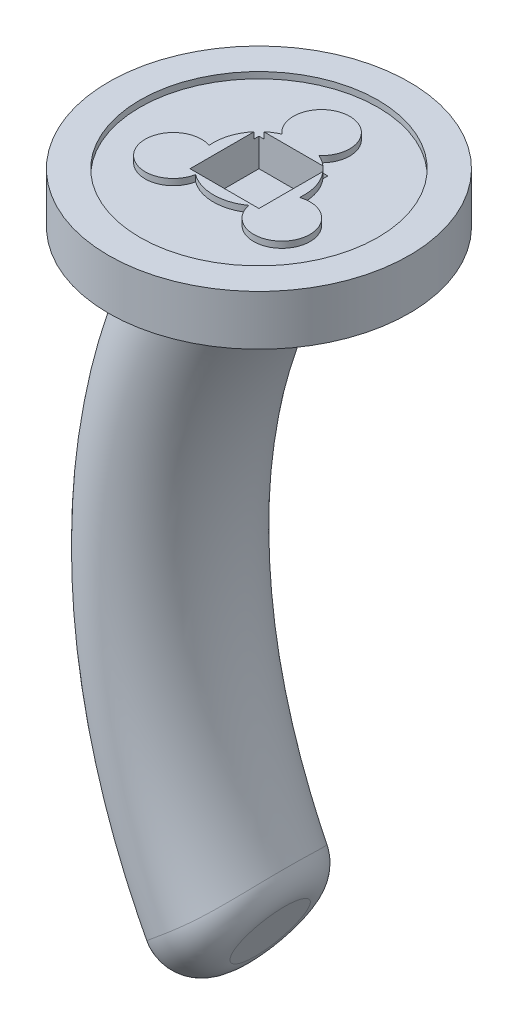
ISO-10303-21;
HEADER;
FILE_DESCRIPTION(('STEP AP214'),'2;1');
FILE_NAME('part.step','',(''),(''),'','','');
FILE_SCHEMA(('AUTOMOTIVE_DESIGN { 1 0 10303 214 1 1 1 1 }'));
ENDSEC;
DATA;
#1=APPLICATION_CONTEXT('core data for automotive mechanical design processes');
#2=APPLICATION_PROTOCOL_DEFINITION('international standard','automotive_design',2000,#1);
#3=PRODUCT_CONTEXT('',#1,'mechanical');
#4=PRODUCT('Part','Part','',(#3));
#5=PRODUCT_RELATED_PRODUCT_CATEGORY('part','',(#4));
#6=PRODUCT_DEFINITION_FORMATION('','',#4);
#7=PRODUCT_DEFINITION_CONTEXT('part definition',#1,'design');
#8=PRODUCT_DEFINITION('design','',#6,#7);
#9=PRODUCT_DEFINITION_SHAPE('','',#8);
#10=(LENGTH_UNIT() NAMED_UNIT(*) SI_UNIT(.MILLI.,.METRE.));
#11=(NAMED_UNIT(*) PLANE_ANGLE_UNIT() SI_UNIT($,.RADIAN.));
#12=(NAMED_UNIT(*) SI_UNIT($,.STERADIAN.) SOLID_ANGLE_UNIT());
#13=UNCERTAINTY_MEASURE_WITH_UNIT(LENGTH_MEASURE(1.E-05),#10,'distance_accuracy_value','');
#14=(GEOMETRIC_REPRESENTATION_CONTEXT(3) GLOBAL_UNCERTAINTY_ASSIGNED_CONTEXT((#13)) GLOBAL_UNIT_ASSIGNED_CONTEXT((#10,
#11,#12)) REPRESENTATION_CONTEXT('',''));
#15=CARTESIAN_POINT('',(0.,0.,0.));
#16=DIRECTION('',(0.,0.,1.));
#17=DIRECTION('',(1.,0.,0.));
#18=AXIS2_PLACEMENT_3D('',#15,#16,#17);
#19=CARTESIAN_POINT('',(0.,7.,0.));
#20=DIRECTION('',(0.,1.,0.));
#21=DIRECTION('',(0.,0.,1.));
#22=AXIS2_PLACEMENT_3D('',#19,#20,#21);
#23=CYLINDRICAL_SURFACE('',#22,7.25);
#24=DIRECTION('',(0.,1.,0.));
#25=VECTOR('',#24,1.);
#26=CARTESIAN_POINT('',(-5.5,7.,-4.7236109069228));
#27=LINE('',#26,#25);
#28=CARTESIAN_POINT('',(-5.5,7.,-4.7236109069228));
#29=VERTEX_POINT('',#28);
#30=CARTESIAN_POINT('',(-5.5,8.,-4.7236109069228));
#31=VERTEX_POINT('',#30);
#32=EDGE_CURVE('E191',#29,#31,#27,.T.);
#33=ORIENTED_EDGE('',*,*,#32,.F.);
#34=CARTESIAN_POINT('',(0.,7.,0.));
#35=DIRECTION('',(0.,1.,0.));
#36=DIRECTION('',(0.,0.,1.));
#37=AXIS2_PLACEMENT_3D('',#34,#35,#36);
#38=CIRCLE('',#37,7.25);
#39=CARTESIAN_POINT('',(-7.21220236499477,7.,0.739349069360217));
#40=VERTEX_POINT('',#39);
#41=EDGE_CURVE('E210',#29,#40,#38,.T.);
#42=ORIENTED_EDGE('',*,*,#41,.T.);
#43=DIRECTION('',(0.,1.,0.));
#44=VECTOR('',#43,1.);
#45=CARTESIAN_POINT('',(-7.21220236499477,7.,0.739349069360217));
#46=LINE('',#45,#44);
#47=CARTESIAN_POINT('',(-7.21220236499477,8.,0.739349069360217));
#48=VERTEX_POINT('',#47);
#49=EDGE_CURVE('E237',#40,#48,#46,.T.);
#50=ORIENTED_EDGE('',*,*,#49,.T.);
#51=CARTESIAN_POINT('',(0.,8.,0.));
#52=DIRECTION('',(0.,1.,0.));
#53=DIRECTION('',(0.,0.,1.));
#54=AXIS2_PLACEMENT_3D('',#51,#52,#53);
#55=CIRCLE('',#54,7.25);
#56=EDGE_CURVE('E228',#31,#48,#55,.T.);
#57=ORIENTED_EDGE('',*,*,#56,.F.);
#58=EDGE_LOOP('',(#33,#42,#50,#57));
#59=FACE_BOUND('',#58,.T.);
#60=ADVANCED_FACE('F35',(#59),#23,.T.);
#61=CARTESIAN_POINT('',(0.,7.,0.));
#62=DIRECTION('',(0.,1.,0.));
#63=DIRECTION('',(0.,0.,1.));
#64=AXIS2_PLACEMENT_3D('',#61,#62,#63);
#65=CYLINDRICAL_SURFACE('',#64,7.25);
#66=DIRECTION('',(0.,1.,0.));
#67=VECTOR('',#66,1.);
#68=CARTESIAN_POINT('',(4.7236109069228,7.,-5.5));
#69=LINE('',#68,#67);
#70=CARTESIAN_POINT('',(4.7236109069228,7.,-5.5));
#71=VERTEX_POINT('',#70);
#72=CARTESIAN_POINT('',(4.72361090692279,8.,-5.5));
#73=VERTEX_POINT('',#72);
#74=EDGE_CURVE('E184',#71,#73,#69,.T.);
#75=ORIENTED_EDGE('',*,*,#74,.F.);
#76=CARTESIAN_POINT('',(0.,7.,0.));
#77=DIRECTION('',(0.,1.,0.));
#78=DIRECTION('',(0.,0.,1.));
#79=AXIS2_PLACEMENT_3D('',#76,#77,#78);
#80=CIRCLE('',#79,7.25);
#81=CARTESIAN_POINT('',(2.96580610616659,7.,-6.615625));
#82=VERTEX_POINT('',#81);
#83=EDGE_CURVE('E203',#71,#82,#80,.T.);
#84=ORIENTED_EDGE('',*,*,#83,.T.);
#85=DIRECTION('',(0.,1.,0.));
#86=VECTOR('',#85,1.);
#87=CARTESIAN_POINT('',(2.96580610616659,7.,-6.615625));
#88=LINE('',#87,#86);
#89=CARTESIAN_POINT('',(2.96580610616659,8.,-6.615625));
#90=VERTEX_POINT('',#89);
#91=EDGE_CURVE('E242',#82,#90,#88,.T.);
#92=ORIENTED_EDGE('',*,*,#91,.T.);
#93=CARTESIAN_POINT('',(0.,8.,0.));
#94=DIRECTION('',(0.,1.,0.));
#95=DIRECTION('',(0.,0.,1.));
#96=AXIS2_PLACEMENT_3D('',#93,#94,#95);
#97=CIRCLE('',#96,7.25);
#98=EDGE_CURVE('E223',#73,#90,#97,.T.);
#99=ORIENTED_EDGE('',*,*,#98,.F.);
#100=EDGE_LOOP('',(#75,#84,#92,#99));
#101=FACE_BOUND('',#100,.T.);
#102=ADVANCED_FACE('F294',(#101),#65,.T.);
#103=CARTESIAN_POINT('',(0.,8.,0.));
#104=DIRECTION('',(0.,1.,0.));
#105=DIRECTION('',(0.,0.,1.));
#106=AXIS2_PLACEMENT_3D('',#103,#104,#105);
#107=PLANE('',#106);
#108=DIRECTION('',(-1.,0.,0.));
#109=VECTOR('',#108,1.);
#110=CARTESIAN_POINT('',(0.,8.,-5.5));
#111=LINE('',#110,#109);
#112=CARTESIAN_POINT('',(-4.7236109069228,8.,-5.5));
#113=VERTEX_POINT('',#112);
#114=EDGE_CURVE('E260',#73,#113,#111,.T.);
#115=ORIENTED_EDGE('',*,*,#114,.F.);
#116=ORIENTED_EDGE('',*,*,#98,.T.);
#117=CARTESIAN_POINT('',(0.,8.,-10.));
#118=DIRECTION('',(0.,1.,0.));
#119=DIRECTION('',(0.,0.,1.));
#120=AXIS2_PLACEMENT_3D('',#117,#118,#119);
#121=CIRCLE('',#120,4.5);
#122=CARTESIAN_POINT('',(-2.96580610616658,8.,-6.615625));
#123=VERTEX_POINT('',#122);
#124=EDGE_CURVE('E225',#90,#123,#121,.T.);
#125=ORIENTED_EDGE('',*,*,#124,.T.);
#126=EDGE_CURVE('E229',#123,#113,#55,.T.);
#127=ORIENTED_EDGE('',*,*,#126,.T.);
#128=EDGE_LOOP('',(#115,#116,#125,#127));
#129=FACE_BOUND('',#128,.T.);
#130=ADVANCED_FACE('F301',(#129),#107,.T.);
#131=CARTESIAN_POINT('',(0.,8.,0.));
#132=DIRECTION('',(0.,-1.,0.));
#133=DIRECTION('',(0.,0.,-1.));
#134=AXIS2_PLACEMENT_3D('',#131,#132,#133);
#135=CYLINDRICAL_SURFACE('',#134,24.);
#136=CARTESIAN_POINT('',(0.,8.,0.));
#137=DIRECTION('',(0.,1.,0.));
#138=DIRECTION('',(0.,0.,1.));
#139=AXIS2_PLACEMENT_3D('',#136,#137,#138);
#140=CIRCLE('',#139,24.);
#141=CARTESIAN_POINT('',(0.,8.,24.));
#142=VERTEX_POINT('',#141);
#143=EDGE_CURVE('E254',#142,#142,#140,.T.);
#144=ORIENTED_EDGE('',*,*,#143,.F.);
#145=EDGE_LOOP('',(#144));
#146=FACE_BOUND('',#145,.T.);
#147=CARTESIAN_POINT('',(0.,0.,0.));
#148=DIRECTION('',(0.,1.,0.));
#149=DIRECTION('',(0.,0.,1.));
#150=AXIS2_PLACEMENT_3D('',#147,#148,#149);
#151=CIRCLE('',#150,24.);
#152=CARTESIAN_POINT('',(0.,0.,24.));
#153=VERTEX_POINT('',#152);
#154=EDGE_CURVE('E251',#153,#153,#151,.T.);
#155=ORIENTED_EDGE('',*,*,#154,.T.);
#156=EDGE_LOOP('',(#155));
#157=FACE_BOUND('',#156,.T.);
#158=ADVANCED_FACE('F375',(#146,#157),#135,.T.);
#159=CARTESIAN_POINT('',(0.,8.,0.));
#160=DIRECTION('',(0.,1.,0.));
#161=DIRECTION('',(0.,0.,1.));
#162=AXIS2_PLACEMENT_3D('',#159,#160,#161);
#163=CIRCLE('',#162,19.);
#164=CARTESIAN_POINT('',(0.,8.,19.));
#165=VERTEX_POINT('',#164);
#166=EDGE_CURVE('E236',#165,#165,#163,.T.);
#167=ORIENTED_EDGE('',*,*,#166,.F.);
#168=EDGE_LOOP('',(#167));
#169=FACE_BOUND('',#168,.T.);
#170=ORIENTED_EDGE('',*,*,#143,.T.);
#171=EDGE_LOOP('',(#170));
#172=FACE_BOUND('',#171,.T.);
#173=ADVANCED_FACE('F363',(#169,#172),#107,.T.);
#174=CARTESIAN_POINT('',(0.,0.,0.));
#175=DIRECTION('',(0.,1.,0.));
#176=DIRECTION('',(0.,0.,1.));
#177=AXIS2_PLACEMENT_3D('',#174,#175,#176);
#178=PLANE('',#177);
#179=CARTESIAN_POINT('',(0.,0.,0.));
#180=DIRECTION('',(0.,-1.,0.));
#181=DIRECTION('',(0.,0.,-1.));
#182=AXIS2_PLACEMENT_3D('',#179,#180,#181);
#183=CIRCLE('',#182,12.);
#184=CARTESIAN_POINT('',(0.,0.,-12.));
#185=VERTEX_POINT('',#184);
#186=EDGE_CURVE('E262',#185,#185,#183,.T.);
#187=ORIENTED_EDGE('',*,*,#186,.F.);
#188=EDGE_LOOP('',(#187));
#189=FACE_BOUND('',#188,.T.);
#190=ORIENTED_EDGE('',*,*,#154,.F.);
#191=EDGE_LOOP('',(#190));
#192=FACE_BOUND('',#191,.T.);
#193=ADVANCED_FACE('F371',(#189,#192),#178,.F.);
#194=CARTESIAN_POINT('',(0.,7.,0.));
#195=DIRECTION('',(0.,1.,0.));
#196=DIRECTION('',(0.,0.,1.));
#197=AXIS2_PLACEMENT_3D('',#194,#195,#196);
#198=CYLINDRICAL_SURFACE('',#197,19.);
#199=CARTESIAN_POINT('',(0.,7.,0.));
#200=DIRECTION('',(0.,1.,0.));
#201=DIRECTION('',(0.,0.,1.));
#202=AXIS2_PLACEMENT_3D('',#199,#200,#201);
#203=CIRCLE('',#202,19.);
#204=CARTESIAN_POINT('',(0.,7.,19.));
#205=VERTEX_POINT('',#204);
#206=EDGE_CURVE('E248',#205,#205,#203,.T.);
#207=ORIENTED_EDGE('',*,*,#206,.F.);
#208=EDGE_LOOP('',(#207));
#209=FACE_BOUND('',#208,.T.);
#210=ORIENTED_EDGE('',*,*,#166,.T.);
#211=EDGE_LOOP('',(#210));
#212=FACE_BOUND('',#211,.T.);
#213=ADVANCED_FACE('F369',(#209,#212),#198,.F.);
#214=CARTESIAN_POINT('',(0.,7.,0.));
#215=DIRECTION('',(0.,1.,0.));
#216=DIRECTION('',(0.,0.,1.));
#217=AXIS2_PLACEMENT_3D('',#214,#215,#216);
#218=PLANE('',#217);
#219=DIRECTION('',(0.,0.,1.));
#220=VECTOR('',#219,1.);
#221=CARTESIAN_POINT('',(-5.5,7.,0.));
#222=LINE('',#221,#220);
#223=CARTESIAN_POINT('',(-5.5,7.,-5.5));
#224=VERTEX_POINT('',#223);
#225=EDGE_CURVE('E193',#224,#29,#222,.T.);
#226=ORIENTED_EDGE('',*,*,#225,.F.);
#227=DIRECTION('',(-1.,0.,0.));
#228=VECTOR('',#227,1.);
#229=CARTESIAN_POINT('',(0.,7.,-5.5));
#230=LINE('',#229,#228);
#231=CARTESIAN_POINT('',(-4.7236109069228,7.,-5.5));
#232=VERTEX_POINT('',#231);
#233=EDGE_CURVE('E189',#232,#224,#230,.T.);
#234=ORIENTED_EDGE('',*,*,#233,.F.);
#235=CARTESIAN_POINT('',(-2.96580610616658,7.,-6.615625));
#236=VERTEX_POINT('',#235);
#237=EDGE_CURVE('E211',#236,#232,#38,.T.);
#238=ORIENTED_EDGE('',*,*,#237,.F.);
#239=CARTESIAN_POINT('',(0.,7.,-10.));
#240=DIRECTION('',(0.,1.,0.));
#241=DIRECTION('',(0.,0.,1.));
#242=AXIS2_PLACEMENT_3D('',#239,#240,#241);
#243=CIRCLE('',#242,4.5);
#244=EDGE_CURVE('E207',#82,#236,#243,.T.);
#245=ORIENTED_EDGE('',*,*,#244,.F.);
#246=ORIENTED_EDGE('',*,*,#83,.F.);
#247=CARTESIAN_POINT('',(5.5,7.,-5.5));
#248=VERTEX_POINT('',#247);
#249=EDGE_CURVE('E186',#248,#71,#230,.T.);
#250=ORIENTED_EDGE('',*,*,#249,.F.);
#251=DIRECTION('',(0.,0.,-1.));
#252=VECTOR('',#251,1.);
#253=CARTESIAN_POINT('',(5.5,7.,0.));
#254=LINE('',#253,#252);
#255=CARTESIAN_POINT('',(5.5,7.,-4.7236109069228));
#256=VERTEX_POINT('',#255);
#257=EDGE_CURVE('E182',#256,#248,#254,.T.);
#258=ORIENTED_EDGE('',*,*,#257,.F.);
#259=CARTESIAN_POINT('',(7.21220236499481,7.,0.739349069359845));
#260=VERTEX_POINT('',#259);
#261=EDGE_CURVE('E204',#260,#256,#80,.T.);
#262=ORIENTED_EDGE('',*,*,#261,.F.);
#263=CARTESIAN_POINT('',(8.66025403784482,7.,4.999999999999));
#264=DIRECTION('',(0.,1.,0.));
#265=DIRECTION('',(0.,0.,1.));
#266=AXIS2_PLACEMENT_3D('',#263,#264,#265);
#267=CIRCLE('',#266,4.5);
#268=CARTESIAN_POINT('',(4.24639625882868,7.,5.87627593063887));
#269=VERTEX_POINT('',#268);
#270=EDGE_CURVE('E199',#269,#260,#267,.T.);
#271=ORIENTED_EDGE('',*,*,#270,.F.);
#272=CARTESIAN_POINT('',(0.,7.,0.));
#273=DIRECTION('',(0.,1.,0.));
#274=DIRECTION('',(0.,0.,1.));
#275=AXIS2_PLACEMENT_3D('',#272,#273,#274);
#276=CIRCLE('',#275,7.25);
#277=CARTESIAN_POINT('',(-4.24639625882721,7.,5.87627593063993));
#278=VERTEX_POINT('',#277);
#279=EDGE_CURVE('E196',#278,#269,#276,.T.);
#280=ORIENTED_EDGE('',*,*,#279,.F.);
#281=CARTESIAN_POINT('',(-8.66025403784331,7.,4.99999999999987));
#282=DIRECTION('',(0.,1.,0.));
#283=DIRECTION('',(0.,0.,1.));
#284=AXIS2_PLACEMENT_3D('',#281,#282,#283);
#285=CIRCLE('',#284,4.5);
#286=EDGE_CURVE('E214',#40,#278,#285,.T.);
#287=ORIENTED_EDGE('',*,*,#286,.F.);
#288=ORIENTED_EDGE('',*,*,#41,.F.);
#289=EDGE_LOOP('',(#226,#234,#238,#245,#246,#250,#258,#262,#271,#280,#287,#288));
#290=FACE_BOUND('',#289,.T.);
#291=ORIENTED_EDGE('',*,*,#206,.T.);
#292=EDGE_LOOP('',(#291));
#293=FACE_BOUND('',#292,.T.);
#294=ADVANCED_FACE('F332',(#290,#293),#218,.T.);
#295=CARTESIAN_POINT('',(0.,7.,0.));
#296=DIRECTION('',(0.,1.,0.));
#297=DIRECTION('',(0.,0.,1.));
#298=AXIS2_PLACEMENT_3D('',#295,#296,#297);
#299=CYLINDRICAL_SURFACE('',#298,7.25);
#300=CARTESIAN_POINT('',(0.,8.,0.));
#301=DIRECTION('',(0.,1.,0.));
#302=DIRECTION('',(0.,0.,1.));
#303=AXIS2_PLACEMENT_3D('',#300,#301,#302);
#304=CIRCLE('',#303,7.25);
#305=CARTESIAN_POINT('',(-4.24639625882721,8.,5.87627593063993));
#306=VERTEX_POINT('',#305);
#307=CARTESIAN_POINT('',(4.24639625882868,8.,5.87627593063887));
#308=VERTEX_POINT('',#307);
#309=EDGE_CURVE('E195',#306,#308,#304,.T.);
#310=ORIENTED_EDGE('',*,*,#309,.F.);
#311=DIRECTION('',(0.,1.,0.));
#312=VECTOR('',#311,1.);
#313=CARTESIAN_POINT('',(-4.24639625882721,7.,5.87627593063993));
#314=LINE('',#313,#312);
#315=EDGE_CURVE('E234',#278,#306,#314,.T.);
#316=ORIENTED_EDGE('',*,*,#315,.F.);
#317=ORIENTED_EDGE('',*,*,#279,.T.);
#318=DIRECTION('',(0.,1.,0.));
#319=VECTOR('',#318,1.);
#320=CARTESIAN_POINT('',(4.24639625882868,7.,5.87627593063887));
#321=LINE('',#320,#319);
#322=EDGE_CURVE('E217',#269,#308,#321,.T.);
#323=ORIENTED_EDGE('',*,*,#322,.T.);
#324=EDGE_LOOP('',(#310,#316,#317,#323));
#325=FACE_BOUND('',#324,.T.);
#326=ADVANCED_FACE('F317',(#325),#299,.T.);
#327=CARTESIAN_POINT('',(-8.66025403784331,7.,4.99999999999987));
#328=DIRECTION('',(0.,1.,0.));
#329=DIRECTION('',(0.,0.,1.));
#330=AXIS2_PLACEMENT_3D('',#327,#328,#329);
#331=CYLINDRICAL_SURFACE('',#330,4.5);
#332=CARTESIAN_POINT('',(-8.66025403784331,8.,4.99999999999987));
#333=DIRECTION('',(0.,1.,0.));
#334=DIRECTION('',(0.,0.,1.));
#335=AXIS2_PLACEMENT_3D('',#332,#333,#334);
#336=CIRCLE('',#335,4.5);
#337=EDGE_CURVE('E200',#48,#306,#336,.T.);
#338=ORIENTED_EDGE('',*,*,#337,.F.);
#339=ORIENTED_EDGE('',*,*,#49,.F.);
#340=ORIENTED_EDGE('',*,*,#286,.T.);
#341=ORIENTED_EDGE('',*,*,#315,.T.);
#342=EDGE_LOOP('',(#338,#339,#340,#341));
#343=FACE_BOUND('',#342,.T.);
#344=ADVANCED_FACE('F310',(#343),#331,.T.);
#345=DIRECTION('',(0.,1.,0.));
#346=VECTOR('',#345,1.);
#347=CARTESIAN_POINT('',(-4.7236109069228,7.,-5.5));
#348=LINE('',#347,#346);
#349=EDGE_CURVE('E188',#113,#232,#348,.F.);
#350=ORIENTED_EDGE('',*,*,#349,.F.);
#351=ORIENTED_EDGE('',*,*,#126,.F.);
#352=DIRECTION('',(0.,1.,0.));
#353=VECTOR('',#352,1.);
#354=CARTESIAN_POINT('',(-2.96580610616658,7.,-6.615625));
#355=LINE('',#354,#353);
#356=EDGE_CURVE('E240',#236,#123,#355,.T.);
#357=ORIENTED_EDGE('',*,*,#356,.F.);
#358=ORIENTED_EDGE('',*,*,#237,.T.);
#359=EDGE_LOOP('',(#350,#351,#357,#358));
#360=FACE_BOUND('',#359,.T.);
#361=ADVANCED_FACE('F297',(#360),#23,.T.);
#362=CARTESIAN_POINT('',(0.,7.,-10.));
#363=DIRECTION('',(0.,1.,0.));
#364=DIRECTION('',(0.,0.,1.));
#365=AXIS2_PLACEMENT_3D('',#362,#363,#364);
#366=CYLINDRICAL_SURFACE('',#365,4.5);
#367=ORIENTED_EDGE('',*,*,#124,.F.);
#368=ORIENTED_EDGE('',*,*,#91,.F.);
#369=ORIENTED_EDGE('',*,*,#244,.T.);
#370=ORIENTED_EDGE('',*,*,#356,.T.);
#371=EDGE_LOOP('',(#367,#368,#369,#370));
#372=FACE_BOUND('',#371,.T.);
#373=ADVANCED_FACE('F309',(#372),#366,.T.);
#374=DIRECTION('',(0.,1.,0.));
#375=VECTOR('',#374,1.);
#376=CARTESIAN_POINT('',(5.5,7.,-4.7236109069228));
#377=LINE('',#376,#375);
#378=CARTESIAN_POINT('',(5.5,8.,-4.7236109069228));
#379=VERTEX_POINT('',#378);
#380=EDGE_CURVE('E176',#379,#256,#377,.F.);
#381=ORIENTED_EDGE('',*,*,#380,.F.);
#382=CARTESIAN_POINT('',(7.21220236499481,8.,0.739349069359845));
#383=VERTEX_POINT('',#382);
#384=EDGE_CURVE('E62',#383,#379,#97,.T.);
#385=ORIENTED_EDGE('',*,*,#384,.F.);
#386=DIRECTION('',(0.,1.,0.));
#387=VECTOR('',#386,1.);
#388=CARTESIAN_POINT('',(7.21220236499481,7.,0.739349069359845));
#389=LINE('',#388,#387);
#390=EDGE_CURVE('E245',#260,#383,#389,.T.);
#391=ORIENTED_EDGE('',*,*,#390,.F.);
#392=ORIENTED_EDGE('',*,*,#261,.T.);
#393=EDGE_LOOP('',(#381,#385,#391,#392));
#394=FACE_BOUND('',#393,.T.);
#395=ADVANCED_FACE('F304',(#394),#65,.T.);
#396=CARTESIAN_POINT('',(8.66025403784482,7.,4.999999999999));
#397=DIRECTION('',(0.,1.,0.));
#398=DIRECTION('',(0.,0.,1.));
#399=AXIS2_PLACEMENT_3D('',#396,#397,#398);
#400=CYLINDRICAL_SURFACE('',#399,4.5);
#401=CARTESIAN_POINT('',(8.66025403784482,8.,4.999999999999));
#402=DIRECTION('',(0.,1.,0.));
#403=DIRECTION('',(0.,0.,1.));
#404=AXIS2_PLACEMENT_3D('',#401,#402,#403);
#405=CIRCLE('',#404,4.5);
#406=EDGE_CURVE('E220',#308,#383,#405,.T.);
#407=ORIENTED_EDGE('',*,*,#406,.F.);
#408=ORIENTED_EDGE('',*,*,#322,.F.);
#409=ORIENTED_EDGE('',*,*,#270,.T.);
#410=ORIENTED_EDGE('',*,*,#390,.T.);
#411=EDGE_LOOP('',(#407,#408,#409,#410));
#412=FACE_BOUND('',#411,.T.);
#413=ADVANCED_FACE('F355',(#412),#400,.T.);
#414=DIRECTION('',(0.,0.,1.));
#415=VECTOR('',#414,1.);
#416=CARTESIAN_POINT('',(-5.5,8.,0.));
#417=LINE('',#416,#415);
#418=CARTESIAN_POINT('',(-5.5,8.,5.5));
#419=VERTEX_POINT('',#418);
#420=EDGE_CURVE('E148',#31,#419,#417,.T.);
#421=ORIENTED_EDGE('',*,*,#420,.F.);
#422=ORIENTED_EDGE('',*,*,#56,.T.);
#423=ORIENTED_EDGE('',*,*,#337,.T.);
#424=ORIENTED_EDGE('',*,*,#309,.T.);
#425=ORIENTED_EDGE('',*,*,#406,.T.);
#426=ORIENTED_EDGE('',*,*,#384,.T.);
#427=DIRECTION('',(0.,0.,-1.));
#428=VECTOR('',#427,1.);
#429=CARTESIAN_POINT('',(5.5,8.,-5.5));
#430=LINE('',#429,#428);
#431=CARTESIAN_POINT('',(5.5,8.,5.5));
#432=VERTEX_POINT('',#431);
#433=EDGE_CURVE('E163',#432,#379,#430,.T.);
#434=ORIENTED_EDGE('',*,*,#433,.F.);
#435=DIRECTION('',(1.,0.,0.));
#436=VECTOR('',#435,1.);
#437=CARTESIAN_POINT('',(5.5,8.,5.5));
#438=LINE('',#437,#436);
#439=EDGE_CURVE('E165',#419,#432,#438,.T.);
#440=ORIENTED_EDGE('',*,*,#439,.F.);
#441=EDGE_LOOP('',(#421,#422,#423,#424,#425,#426,#434,#440));
#442=FACE_BOUND('',#441,.T.);
#443=ADVANCED_FACE('F345',(#442),#107,.T.);
#444=CARTESIAN_POINT('',(-5.5,2.5,5.5));
#445=DIRECTION('',(-1.,0.,0.));
#446=DIRECTION('',(0.,0.,1.));
#447=AXIS2_PLACEMENT_3D('',#444,#445,#446);
#448=PLANE('',#447);
#449=ORIENTED_EDGE('',*,*,#225,.T.);
#450=ORIENTED_EDGE('',*,*,#32,.T.);
#451=ORIENTED_EDGE('',*,*,#420,.T.);
#452=DIRECTION('',(0.,1.,0.));
#453=VECTOR('',#452,1.);
#454=CARTESIAN_POINT('',(-5.5,2.5,5.5));
#455=LINE('',#454,#453);
#456=CARTESIAN_POINT('',(-5.5,2.5,5.5));
#457=VERTEX_POINT('',#456);
#458=EDGE_CURVE('E54',#457,#419,#455,.T.);
#459=ORIENTED_EDGE('',*,*,#458,.F.);
#460=DIRECTION('',(0.,0.,1.));
#461=VECTOR('',#460,1.);
#462=CARTESIAN_POINT('',(-5.5,2.5,5.5));
#463=LINE('',#462,#461);
#464=CARTESIAN_POINT('',(-5.5,2.5,-5.5));
#465=VERTEX_POINT('',#464);
#466=EDGE_CURVE('E145',#465,#457,#463,.T.);
#467=ORIENTED_EDGE('',*,*,#466,.F.);
#468=DIRECTION('',(0.,1.,0.));
#469=VECTOR('',#468,1.);
#470=CARTESIAN_POINT('',(-5.5,2.5,-5.5));
#471=LINE('',#470,#469);
#472=EDGE_CURVE('E174',#465,#224,#471,.T.);
#473=ORIENTED_EDGE('',*,*,#472,.T.);
#474=EDGE_LOOP('',(#449,#450,#451,#459,#467,#473));
#475=FACE_BOUND('',#474,.T.);
#476=ADVANCED_FACE('F142',(#475),#448,.F.);
#477=CARTESIAN_POINT('',(-5.5,2.5,-5.5));
#478=DIRECTION('',(0.,0.,-1.));
#479=DIRECTION('',(-1.,0.,0.));
#480=AXIS2_PLACEMENT_3D('',#477,#478,#479);
#481=PLANE('',#480);
#482=ORIENTED_EDGE('',*,*,#233,.T.);
#483=ORIENTED_EDGE('',*,*,#472,.F.);
#484=DIRECTION('',(-1.,0.,0.));
#485=VECTOR('',#484,1.);
#486=CARTESIAN_POINT('',(-5.5,2.5,-5.5));
#487=LINE('',#486,#485);
#488=CARTESIAN_POINT('',(5.5,2.5,-5.5));
#489=VERTEX_POINT('',#488);
#490=EDGE_CURVE('E151',#489,#465,#487,.T.);
#491=ORIENTED_EDGE('',*,*,#490,.F.);
#492=DIRECTION('',(0.,1.,0.));
#493=VECTOR('',#492,1.);
#494=CARTESIAN_POINT('',(5.5,2.5,-5.5));
#495=LINE('',#494,#493);
#496=EDGE_CURVE('E177',#489,#248,#495,.T.);
#497=ORIENTED_EDGE('',*,*,#496,.T.);
#498=ORIENTED_EDGE('',*,*,#249,.T.);
#499=ORIENTED_EDGE('',*,*,#74,.T.);
#500=ORIENTED_EDGE('',*,*,#114,.T.);
#501=ORIENTED_EDGE('',*,*,#349,.T.);
#502=EDGE_LOOP('',(#482,#483,#491,#497,#498,#499,#500,#501));
#503=FACE_BOUND('',#502,.T.);
#504=ADVANCED_FACE('F336',(#503),#481,.F.);
#505=CARTESIAN_POINT('',(5.5,2.5,-5.5));
#506=DIRECTION('',(1.,0.,0.));
#507=DIRECTION('',(0.,0.,-1.));
#508=AXIS2_PLACEMENT_3D('',#505,#506,#507);
#509=PLANE('',#508);
#510=ORIENTED_EDGE('',*,*,#257,.T.);
#511=ORIENTED_EDGE('',*,*,#496,.F.);
#512=DIRECTION('',(0.,0.,-1.));
#513=VECTOR('',#512,1.);
#514=CARTESIAN_POINT('',(5.5,2.5,-5.5));
#515=LINE('',#514,#513);
#516=CARTESIAN_POINT('',(5.5,2.5,5.5));
#517=VERTEX_POINT('',#516);
#518=EDGE_CURVE('E159',#517,#489,#515,.T.);
#519=ORIENTED_EDGE('',*,*,#518,.F.);
#520=DIRECTION('',(0.,1.,0.));
#521=VECTOR('',#520,1.);
#522=CARTESIAN_POINT('',(5.5,2.5,5.5));
#523=LINE('',#522,#521);
#524=EDGE_CURVE('E150',#517,#432,#523,.T.);
#525=ORIENTED_EDGE('',*,*,#524,.T.);
#526=ORIENTED_EDGE('',*,*,#433,.T.);
#527=ORIENTED_EDGE('',*,*,#380,.T.);
#528=EDGE_LOOP('',(#510,#511,#519,#525,#526,#527));
#529=FACE_BOUND('',#528,.T.);
#530=ADVANCED_FACE('F348',(#529),#509,.F.);
#531=CARTESIAN_POINT('',(5.5,2.5,5.5));
#532=DIRECTION('',(0.,0.,1.));
#533=DIRECTION('',(1.,0.,0.));
#534=AXIS2_PLACEMENT_3D('',#531,#532,#533);
#535=PLANE('',#534);
#536=ORIENTED_EDGE('',*,*,#439,.T.);
#537=ORIENTED_EDGE('',*,*,#524,.F.);
#538=DIRECTION('',(1.,0.,0.));
#539=VECTOR('',#538,1.);
#540=CARTESIAN_POINT('',(5.5,2.5,5.5));
#541=LINE('',#540,#539);
#542=EDGE_CURVE('E154',#457,#517,#541,.T.);
#543=ORIENTED_EDGE('',*,*,#542,.F.);
#544=ORIENTED_EDGE('',*,*,#458,.T.);
#545=EDGE_LOOP('',(#536,#537,#543,#544));
#546=FACE_BOUND('',#545,.T.);
#547=ADVANCED_FACE('F155',(#546),#535,.F.);
#548=CARTESIAN_POINT('',(0.,2.5,0.));
#549=DIRECTION('',(0.,-1.,0.));
#550=DIRECTION('',(0.,0.,-1.));
#551=AXIS2_PLACEMENT_3D('',#548,#549,#550);
#552=PLANE('',#551);
#553=ORIENTED_EDGE('',*,*,#466,.T.);
#554=ORIENTED_EDGE('',*,*,#542,.T.);
#555=ORIENTED_EDGE('',*,*,#518,.T.);
#556=ORIENTED_EDGE('',*,*,#490,.T.);
#557=EDGE_LOOP('',(#553,#554,#555,#556));
#558=FACE_BOUND('',#557,.T.);
#559=ADVANCED_FACE('F161',(#558),#552,.F.);
#560=CARTESIAN_POINT('',(0.,-100.,0.));
#561=DIRECTION('',(0.891093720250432,-0.453819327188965,0.));
#562=DIRECTION('',(0.,0.,-1.));
#563=AXIS2_PLACEMENT_3D('',#560,#561,#562);
#564=CIRCLE('',#563,12.);
#565=CARTESIAN_POINT('',(81.5749956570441,-50.,0.));
#566=DIRECTION('',(0.,0.,-1.));
#567=AXIS1_PLACEMENT('',#565,#566);
#568=SURFACE_OF_REVOLUTION('',#564,#567);
#569=CARTESIAN_POINT('',(3.43602904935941,-93.2532095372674,-4.14432950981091));
#570=CARTESIAN_POINT('',(3.99931050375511,-92.1471822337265,-5.14287693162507));
#571=CARTESIAN_POINT('',(3.78427376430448,-90.828212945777,-6.00991704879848));
#572=CARTESIAN_POINT('',(3.56923702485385,-89.5092436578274,-6.8769571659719));
#573=CARTESIAN_POINT('',(2.63252216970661,-88.324745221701,-7.38411402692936));
#574=CARTESIAN_POINT('',(3.39418464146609,-93.3353728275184,-4.25894178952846));
#575=CARTESIAN_POINT('',(3.9514148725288,-92.2412273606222,-5.29800743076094));
#576=CARTESIAN_POINT('',(3.71748615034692,-90.9287201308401,-6.19773611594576));
#577=CARTESIAN_POINT('',(3.48347501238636,-89.6163369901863,-7.09769743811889));
#578=CARTESIAN_POINT('',(2.52097261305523,-88.4373833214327,-7.61721102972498));
#579=CARTESIAN_POINT('',(3.35039402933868,-93.4213575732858,-4.370088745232));
#580=CARTESIAN_POINT('',(3.90095590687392,-92.3403057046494,-5.45085426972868));
#581=CARTESIAN_POINT('',(3.64638672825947,-91.0349723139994,-6.38396469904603));
#582=CARTESIAN_POINT('',(3.39170499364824,-89.7298057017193,-7.31734938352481));
#583=CARTESIAN_POINT('',(2.40136186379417,-88.5568132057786,-7.84832480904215));
#584=CARTESIAN_POINT('',(3.2590116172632,-93.600790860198,-4.58452899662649));
#585=CARTESIAN_POINT('',(3.7946411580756,-92.5490592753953,-5.75161755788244));
#586=CARTESIAN_POINT('',(3.494577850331,-91.2597806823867,-6.75279694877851));
#587=CARTESIAN_POINT('',(3.19440100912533,-89.9706701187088,-7.75425138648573));
#588=CARTESIAN_POINT('',(2.14375042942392,-88.810374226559,-8.30535558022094));
#589=CARTESIAN_POINT('',(3.21142018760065,-93.6942386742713,-4.68782305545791));
#590=CARTESIAN_POINT('',(3.73876344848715,-92.6587775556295,-5.89956788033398));
#591=CARTESIAN_POINT('',(3.41386933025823,-91.3783356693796,-6.93540096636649));
#592=CARTESIAN_POINT('',(3.08882112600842,-90.0981178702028,-7.9715572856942));
#593=CARTESIAN_POINT('',(2.00575153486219,-88.9445039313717,-8.53127307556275));
#594=CARTESIAN_POINT('',(3.11260718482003,-93.8882622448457,-4.88542587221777));
#595=CARTESIAN_POINT('',(3.6213463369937,-92.8893310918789,-6.18979003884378));
#596=CARTESIAN_POINT('',(3.24167728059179,-91.6286746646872,-7.29614520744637));
#597=CARTESIAN_POINT('',(2.86185363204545,-90.3682429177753,-8.40282382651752));
#598=CARTESIAN_POINT('',(1.70877492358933,-89.2286649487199,-8.9758081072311));
#599=CARTESIAN_POINT('',(3.06138876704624,-93.988831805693,-4.97974227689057));
#600=CARTESIAN_POINT('',(3.55978212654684,-93.0102150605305,-6.33210482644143));
#601=CARTESIAN_POINT('',(3.15020307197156,-91.7604472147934,-7.47428913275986));
#602=CARTESIAN_POINT('',(2.74041352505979,-90.5109793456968,-8.61685304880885));
#603=CARTESIAN_POINT('',(1.54981534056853,-89.3786824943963,-9.1944317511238));
#604=CARTESIAN_POINT('',(2.95545798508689,-94.1968314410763,-5.15832470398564));
#605=CARTESIAN_POINT('',(3.43053634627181,-93.2639946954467,-6.61038840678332));
#606=CARTESIAN_POINT('',(2.95487186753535,-92.0386303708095,-7.82521451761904));
#607=CARTESIAN_POINT('',(2.47899504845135,-90.8135682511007,-9.04042066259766));
#608=CARTESIAN_POINT('',(1.20765433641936,-89.6962456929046,-9.62164664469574));
#609=CARTESIAN_POINT('',(2.90074614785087,-94.3042604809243,-5.24259223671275));
#610=CARTESIAN_POINT('',(3.36281617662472,-93.3969661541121,-6.74640091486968));
#611=CARTESIAN_POINT('',(2.85101673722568,-92.1850387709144,-7.99799678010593));
#612=CARTESIAN_POINT('',(2.33892616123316,-90.9735167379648,-9.25003602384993));
#613=CARTESIAN_POINT('',(1.02445656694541,-89.8637887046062,-9.83023939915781));
#614=CARTESIAN_POINT('',(2.79773095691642,-94.5065352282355,-5.38631579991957));
#615=CARTESIAN_POINT('',(3.23295909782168,-93.6519460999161,-6.98818341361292));
#616=CARTESIAN_POINT('',(2.64814281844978,-92.467583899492,-8.30738379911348));
#617=CARTESIAN_POINT('',(2.06312726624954,-91.2834993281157,-9.62688858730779));
#618=CARTESIAN_POINT('',(0.664336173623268,-90.1875689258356,-10.1982864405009));
#619=CARTESIAN_POINT('',(2.74993732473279,-94.6003800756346,-5.44754864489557));
#620=CARTESIAN_POINT('',(3.1717988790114,-93.7720368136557,-7.09521375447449));
#621=CARTESIAN_POINT('',(2.55134815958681,-92.6011773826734,-8.44511187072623));
#622=CARTESIAN_POINT('',(1.93063807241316,-91.4306724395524,-9.7953519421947));
#623=CARTESIAN_POINT('',(0.491723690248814,-90.3408188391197,-10.3600335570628));
#624=CARTESIAN_POINT('',(2.65229387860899,-94.792107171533,-5.56146501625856));
#625=CARTESIAN_POINT('',(3.04459623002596,-94.0218046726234,-7.3031545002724));
#626=CARTESIAN_POINT('',(2.3469637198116,-92.8804782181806,-8.71401309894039));
#627=CARTESIAN_POINT('',(1.64907085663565,-91.73950749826,-10.1252135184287));
#628=CARTESIAN_POINT('',(0.126124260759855,-90.6610699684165,-10.6697148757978));
#629=CARTESIAN_POINT('',(2.60244429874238,-94.8899889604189,-5.61414951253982));
#630=CARTESIAN_POINT('',(2.97851710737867,-94.1515538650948,-7.40409054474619));
#631=CARTESIAN_POINT('',(2.23937516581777,-93.0261841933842,-8.8451869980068));
#632=CARTESIAN_POINT('',(1.4998975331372,-91.9012649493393,-10.2866588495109));
#633=CARTESIAN_POINT('',(-0.06686036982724,-90.8280696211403,-10.8176506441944));
#634=CARTESIAN_POINT('',(2.50097833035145,-95.0892217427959,-5.71013460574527));
#635=CARTESIAN_POINT('',(2.84127834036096,-94.4210280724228,-7.59829837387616));
#636=CARTESIAN_POINT('',(2.01275025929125,-93.3303224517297,-9.09835973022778));
#637=CARTESIAN_POINT('',(1.18388714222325,-92.2400665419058,-10.5987949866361));
#638=CARTESIAN_POINT('',(-0.473370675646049,-91.1756800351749,-11.0945425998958));
#639=CARTESIAN_POINT('',(2.44936398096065,-95.1905687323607,-5.75344563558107));
#640=CARTESIAN_POINT('',(2.77007968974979,-94.5608296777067,-7.69159796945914));
#641=CARTESIAN_POINT('',(1.89372684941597,-93.4887403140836,-9.22036866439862));
#642=CARTESIAN_POINT('',(1.01694925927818,-92.4172120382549,-10.7495333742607));
#643=CARTESIAN_POINT('',(-0.686873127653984,-91.3562753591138,-11.2235198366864));
#644=CARTESIAN_POINT('',(2.34461935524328,-95.3962392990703,-5.83003223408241));
#645=CARTESIAN_POINT('',(2.62245986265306,-94.8506875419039,-7.86859975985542));
#646=CARTESIAN_POINT('',(1.64410369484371,-93.8186075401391,-9.4518605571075));
#647=CARTESIAN_POINT('',(0.665323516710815,-92.7870880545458,-11.0355144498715));
#648=CARTESIAN_POINT('',(-1.1328078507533,-91.7300955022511,-11.4566512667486));
#649=CARTESIAN_POINT('',(2.29148910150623,-95.5005628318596,-5.86330795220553));
#650=CARTESIAN_POINT('',(2.54598917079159,-95.0008410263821,-7.95230744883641));
#651=CARTESIAN_POINT('',(1.51350412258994,-93.9900567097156,-9.56134370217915));
#652=CARTESIAN_POINT('',(0.480499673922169,-92.9799511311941,-11.1707660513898));
#653=CARTESIAN_POINT('',(-1.36523983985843,-91.9233201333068,-11.5608058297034));
#654=CARTESIAN_POINT('',(2.18386517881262,-95.7118870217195,-5.91937139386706));
#655=CARTESIAN_POINT('',(2.38781392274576,-95.3114249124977,-8.10779798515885));
#656=CARTESIAN_POINT('',(1.24144259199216,-94.3457304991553,-9.76386289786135));
#657=CARTESIAN_POINT('',(0.0945490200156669,-93.3807191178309,-11.4203171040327));
#658=CARTESIAN_POINT('',(-1.84510799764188,-92.3203606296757,-11.7386470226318));
#659=CARTESIAN_POINT('',(2.12936677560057,-95.818896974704,-5.94211512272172));
#660=CARTESIAN_POINT('',(2.30604138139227,-95.4719888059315,-8.17951067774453));
#661=CARTESIAN_POINT('',(1.09993789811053,-94.5300050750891,-9.85682897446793));
#662=CARTESIAN_POINT('',(-0.106772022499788,-93.5888105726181,-11.5344894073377));
#663=CARTESIAN_POINT('',(-2.09260230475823,-92.524217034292,-11.8122057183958));
#664=CARTESIAN_POINT('',(2.01965776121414,-96.0343153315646,-5.97660503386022));
#665=CARTESIAN_POINT('',(2.13841104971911,-95.8011381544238,-8.30772528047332));
#666=CARTESIAN_POINT('',(0.809389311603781,-94.9081967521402,-10.021394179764));
#667=CARTESIAN_POINT('',(-0.520238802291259,-94.0160447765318,-11.7354078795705));
#668=CARTESIAN_POINT('',(-2.59376065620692,-92.9372129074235,-11.9240433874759));
#669=CARTESIAN_POINT('',(1.96444714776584,-96.1427237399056,-5.98835118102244));
#670=CARTESIAN_POINT('',(2.05251504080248,-95.9697986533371,-8.36417950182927));
#671=CARTESIAN_POINT('',(0.660345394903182,-95.1021138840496,-10.0929932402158));
#672=CARTESIAN_POINT('',(-0.732481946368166,-94.2352876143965,-11.8220642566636));
#673=CARTESIAN_POINT('',(-2.8474247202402,-93.1463523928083,-11.9623222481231));
#674=CARTESIAN_POINT('',(1.85374292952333,-96.3600962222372,-6.00087433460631));
#675=CARTESIAN_POINT('',(1.87789582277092,-96.3126709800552,-8.45961099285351));
#676=CARTESIAN_POINT('',(0.358477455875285,-95.4960808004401,-10.2117869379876));
#677=CARTESIAN_POINT('',(-1.16160240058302,-94.6803537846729,-11.9642247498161));
#678=CARTESIAN_POINT('',(-3.3521165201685,-93.5648174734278,-12.0028898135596));
#679=CARTESIAN_POINT('',(1.79824918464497,-96.4690605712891,-6.00164524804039));
#680=CARTESIAN_POINT('',(1.78915176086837,-96.4869237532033,-8.49850550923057));
#681=CARTESIAN_POINT('',(0.205651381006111,-95.6961339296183,-10.2589680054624));
#682=CARTESIAN_POINT('',(-1.37851950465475,-94.9062271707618,-12.0195802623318));
#683=CARTESIAN_POINT('',(-3.60314271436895,-93.7741431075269,-12.005158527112));
#684=CARTESIAN_POINT('',(1.68744604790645,-96.6866272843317,-5.99252396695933));
#685=CARTESIAN_POINT('',(1.61032045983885,-96.8380666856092,-8.5576053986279));
#686=CARTESIAN_POINT('',(-0.0999433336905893,-96.0984682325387,-10.3278066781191));
#687=CARTESIAN_POINT('',(-1.81088269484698,-95.3597589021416,-12.0981614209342));
#688=CARTESIAN_POINT('',(-4.09506334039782,-94.1883930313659,-11.9763077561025));
#689=CARTESIAN_POINT('',(1.63213665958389,-96.7952296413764,-5.98263156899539));
#690=CARTESIAN_POINT('',(1.52023400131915,-97.0149553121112,-8.57772549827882));
#691=CARTESIAN_POINT('',(-0.252711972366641,-96.3007494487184,-10.3494637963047));
#692=CARTESIAN_POINT('',(-2.02630592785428,-95.5874080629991,-12.121241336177));
#693=CARTESIAN_POINT('',(-4.33595757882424,-94.3933172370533,-11.9451876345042));
#694=CARTESIAN_POINT('',(1.52508727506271,-97.005425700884,-5.95351731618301));
#695=CARTESIAN_POINT('',(1.34492205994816,-97.3591878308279,-8.59865619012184));
#696=CARTESIAN_POINT('',(-0.547078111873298,-96.693360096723,-10.367453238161));
#697=CARTESIAN_POINT('',(-2.43966277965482,-96.028311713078,-12.1362863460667));
#698=CARTESIAN_POINT('',(-4.79044704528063,-94.7848235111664,-11.8565652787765));
#699=CARTESIAN_POINT('',(1.47331675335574,-97.1070793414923,-5.93483212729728));
#700=CARTESIAN_POINT('',(1.25969391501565,-97.5265369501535,-8.60038762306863));
#701=CARTESIAN_POINT('',(-0.688831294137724,-96.8837412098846,-10.3650988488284));
#702=CARTESIAN_POINT('',(-2.63789895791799,-96.2416795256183,-12.129760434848));
#703=CARTESIAN_POINT('',(-5.00481443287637,-94.9717969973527,-11.8005899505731));
#704=CARTESIAN_POINT('',(1.37057027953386,-97.3088264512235,-5.88890564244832));
#705=CARTESIAN_POINT('',(1.09002577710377,-97.8596876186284,-8.58770805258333));
#706=CARTESIAN_POINT('',(-0.968140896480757,-97.2616591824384,-10.339621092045));
#707=CARTESIAN_POINT('',(-3.02685309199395,-96.6643687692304,-12.0914845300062));
#708=CARTESIAN_POINT('',(-5.41891813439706,-95.3377741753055,-11.6669325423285));
#709=CARTESIAN_POINT('',(1.31959428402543,-97.4089200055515,-5.86166481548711));
#710=CARTESIAN_POINT('',(1.00560781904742,-98.0254459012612,-8.57323623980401));
#711=CARTESIAN_POINT('',(-1.10569754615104,-97.4491961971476,-10.3164988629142));
#712=CARTESIAN_POINT('',(-3.21749851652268,-96.8736272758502,-12.0596415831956));
#713=CARTESIAN_POINT('',(-5.61865524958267,-95.5167783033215,-11.5892516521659));
#714=CARTESIAN_POINT('',(1.21866035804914,-97.6071080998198,-5.79914610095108));
#715=CARTESIAN_POINT('',(0.838166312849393,-98.3542244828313,-8.52903958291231));
#716=CARTESIAN_POINT('',(-1.37574141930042,-97.8201091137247,-10.2511821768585));
#717=CARTESIAN_POINT('',(-3.590147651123,-97.28667839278,-11.9732042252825));
#718=CARTESIAN_POINT('',(-6.00335065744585,-95.8662796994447,-11.4158309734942));
#719=CARTESIAN_POINT('',(1.16870264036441,-97.7052022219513,-5.7638665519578));
#720=CARTESIAN_POINT('',(0.755169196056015,-98.5171928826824,-8.49926074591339));
#721=CARTESIAN_POINT('',(-1.50822758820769,-98.00348414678,-10.2089837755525));
#722=CARTESIAN_POINT('',(-3.77207092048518,-97.4903978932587,-11.9185318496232));
#723=CARTESIAN_POINT('',(-6.1883058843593,-96.0367752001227,-11.3200874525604));
#724=CARTESIAN_POINT('',(1.07001433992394,-97.8989809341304,-5.68578089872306));
#725=CARTESIAN_POINT('',(0.591044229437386,-98.8394592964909,-8.42543229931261));
#726=CARTESIAN_POINT('',(-1.76764277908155,-98.3651204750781,-10.1072021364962));
#727=CARTESIAN_POINT('',(-4.12677825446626,-97.8914068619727,-11.788795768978));
#728=CARTESIAN_POINT('',(-6.54397235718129,-96.3691044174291,-11.1135683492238));
#729=CARTESIAN_POINT('',(1.02128385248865,-97.9946653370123,-5.64297421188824));
#730=CARTESIAN_POINT('',(0.509943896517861,-98.9987032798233,-8.38134157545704));
#731=CARTESIAN_POINT('',(-1.89457136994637,-98.5433813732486,-10.0476175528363));
#732=CARTESIAN_POINT('',(-4.29948479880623,-98.0886225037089,-11.7136764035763));
#733=CARTESIAN_POINT('',(-6.71468249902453,-96.5309374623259,-11.002791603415));
#734=CARTESIAN_POINT('',(0.917662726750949,-98.1981298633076,-5.54301636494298));
#735=CARTESIAN_POINT('',(0.337325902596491,-99.3376461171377,-8.27183456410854));
#736=CARTESIAN_POINT('',(-2.16218804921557,-98.9217557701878,-9.90197481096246));
#737=CARTESIAN_POINT('',(-4.66223775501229,-98.506622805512,-11.5318239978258));
#738=CARTESIAN_POINT('',(-7.06857859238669,-96.8708410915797,-10.750168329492));
#739=CARTESIAN_POINT('',(0.863009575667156,-98.3054436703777,-5.48466792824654));
#740=CARTESIAN_POINT('',(0.246267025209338,-99.516444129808,-8.20414248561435));
#741=CARTESIAN_POINT('',(-2.3018978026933,-99.1208932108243,-9.81322606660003));
#742=CARTESIAN_POINT('',(-4.8505261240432,-98.7260075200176,-11.4219745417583));
#743=CARTESIAN_POINT('',(-7.24949979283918,-97.0474588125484,-10.6061758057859));
#744=CARTESIAN_POINT('',(0.755816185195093,-98.5159224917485,-5.35921253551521));
#745=CARTESIAN_POINT('',(0.0675406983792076,-99.8673809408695,-8.0523185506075));
#746=CARTESIAN_POINT('',(-2.57348091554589,-99.5107322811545,-9.61658528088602));
#747=CARTESIAN_POINT('',(-5.21496772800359,-99.1547514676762,-11.1805146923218));
#748=CARTESIAN_POINT('',(-7.5949796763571,-97.3895096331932,-10.3041159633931));
#749=CARTESIAN_POINT('',(0.703276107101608,-98.6190871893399,-5.29210491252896));
#750=CARTESIAN_POINT('',(-0.0200866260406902,-100.039440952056,-7.96815300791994));
#751=CARTESIAN_POINT('',(-2.70535367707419,-99.7014332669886,-9.50869178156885));
#752=CARTESIAN_POINT('',(-5.39102083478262,-99.364007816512,-11.0488661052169));
#753=CARTESIAN_POINT('',(-7.75953711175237,-97.5549418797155,-10.1460475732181));
#754=CARTESIAN_POINT('',(0.600500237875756,-98.820892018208,-5.14973831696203));
#755=CARTESIAN_POINT('',(-0.191630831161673,-100.37627535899,-7.78459284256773));
#756=CARTESIAN_POINT('',(-2.96129668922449,-100.073899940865,-9.27549318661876));
#757=CARTESIAN_POINT('',(-5.7313640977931,-99.7721089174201,-10.7660275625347));
#758=CARTESIAN_POINT('',(-8.07377066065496,-97.8749816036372,-9.81791874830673));
#759=CARTESIAN_POINT('',(0.55026520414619,-98.9195306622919,-5.07447669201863));
#760=CARTESIAN_POINT('',(-0.27550935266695,-100.54097443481,-7.68517264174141));
#761=CARTESIAN_POINT('',(-3.08536438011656,-100.255662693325,-9.15018242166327));
#762=CARTESIAN_POINT('',(-5.89556287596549,-99.9708569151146,-10.6148118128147));
#763=CARTESIAN_POINT('',(-8.22344190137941,-98.029585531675,-9.64785441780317));
#764=CARTESIAN_POINT('',(0.452302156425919,-99.1118853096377,-4.91640437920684));
#765=CARTESIAN_POINT('',(-0.439225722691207,-100.862438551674,-7.47224159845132));
#766=CARTESIAN_POINT('',(-3.32567206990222,-100.609712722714,-8.88369547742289));
#767=CARTESIAN_POINT('',(-6.21246271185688,-100.357494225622,-10.2947670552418));
#768=CARTESIAN_POINT('',(-8.50910041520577,-98.328182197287,-9.29741535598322));
#769=CARTESIAN_POINT('',(0.404574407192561,-99.2056007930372,-4.83359289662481));
#770=CARTESIAN_POINT('',(-0.519028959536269,-101.019135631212,-7.3587181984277));
#771=CARTESIAN_POINT('',(-3.44191124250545,-100.781998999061,-8.74251762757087));
#772=CARTESIAN_POINT('',(-6.36508583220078,-100.545297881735,-10.1259297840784));
#773=CARTESIAN_POINT('',(-8.64508624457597,-98.4721738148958,-9.11703954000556));
#774=CARTESIAN_POINT('',(0.304162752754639,-99.4027633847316,-4.6467616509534));
#775=CARTESIAN_POINT('',(-0.687130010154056,-101.349209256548,-7.09878353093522));
#776=CARTESIAN_POINT('',(-3.6850538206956,-101.14418582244,-8.42118965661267));
#777=CARTESIAN_POINT('',(-6.68337585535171,-100.939755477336,-9.74307063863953));
#778=CARTESIAN_POINT('',(-8.92577394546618,-98.7725913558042,-8.71683655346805));
#779=CARTESIAN_POINT('',(0.251955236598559,-99.5052750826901,-4.54149411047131));
#780=CARTESIAN_POINT('',(-0.774577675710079,-101.520916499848,-6.95009442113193));
#781=CARTESIAN_POINT('',(-3.81056564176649,-101.332321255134,-8.23844901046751));
#782=CARTESIAN_POINT('',(-6.84688012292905,-101.144217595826,-9.52628590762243));
#783=CARTESIAN_POINT('',(-9.06822928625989,-98.9271657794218,-8.4954009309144));
#784=CARTESIAN_POINT('',(0.151432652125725,-99.7026554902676,-4.3223298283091));
#785=CARTESIAN_POINT('',(-0.943182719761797,-101.851979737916,-6.6365484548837));
#786=CARTESIAN_POINT('',(-4.05091346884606,-101.694402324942,-7.85519440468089));
#787=CARTESIAN_POINT('',(-7.1589700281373,-101.537316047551,-9.07331785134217));
#788=CARTESIAN_POINT('',(-9.33733165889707,-99.2223746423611,-8.04199794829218));
#789=CARTESIAN_POINT('',(0.103117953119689,-99.797523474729,-4.20843226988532));
#790=CARTESIAN_POINT('',(-1.02429495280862,-102.011247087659,-6.47169706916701));
#791=CARTESIAN_POINT('',(-4.16574846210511,-101.868346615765,-7.65467876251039));
#792=CARTESIAN_POINT('',(-7.30746287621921,-101.725843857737,-8.83715357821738));
#793=CARTESIAN_POINT('',(-9.46397719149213,-99.3630077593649,-7.81002959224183));
#794=CARTESIAN_POINT('',(-0.0356668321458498,-100.070033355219,-3.85490668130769));
#795=CARTESIAN_POINT('',(-1.25792324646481,-102.469986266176,-5.95429100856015));
#796=CARTESIAN_POINT('',(-4.49418212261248,-102.367970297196,-7.02889978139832));
#797=CARTESIAN_POINT('',(-7.73150495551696,-102.267571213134,-8.10150094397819));
#798=CARTESIAN_POINT('',(-9.82191912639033,-99.7642574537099,-7.10020139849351));
#799=CARTESIAN_POINT('',(-0.120013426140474,-100.235651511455,-3.60337863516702));
#800=CARTESIAN_POINT('',(-1.39999354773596,-102.748947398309,-5.58014026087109));
#801=CARTESIAN_POINT('',(-4.69179554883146,-102.67156947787,-6.57928849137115));
#802=CARTESIAN_POINT('',(-7.98424695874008,-102.595193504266,-7.57668365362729));
#803=CARTESIAN_POINT('',(-10.031318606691,-100.004330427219,-6.60827507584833));
#804=CARTESIAN_POINT('',(-0.277424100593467,-100.544734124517,-3.05127365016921));
#805=CARTESIAN_POINT('',(-1.66608245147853,-103.271424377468,-4.74767493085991));
#806=CARTESIAN_POINT('',(-5.05874184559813,-103.238566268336,-5.58553369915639));
#807=CARTESIAN_POINT('',(-8.45217536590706,-103.2069059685,-6.42128981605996));
#808=CARTESIAN_POINT('',(-10.4138013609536,-100.448506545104,-5.5505594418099));
#809=CARTESIAN_POINT('',(-0.348762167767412,-100.684809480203,-2.74831606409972));
#810=CARTESIAN_POINT('',(-1.78692191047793,-103.508697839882,-4.28527497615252));
#811=CARTESIAN_POINT('',(-5.22386274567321,-103.495788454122,-5.03651060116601));
#812=CARTESIAN_POINT('',(-8.66119136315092,-103.483484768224,-5.78614587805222));
#813=CARTESIAN_POINT('',(-10.5818435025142,-100.647345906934,-4.98212272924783));
#814=CARTESIAN_POINT('',(-0.468221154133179,-100.919372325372,-2.12088807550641));
#815=CARTESIAN_POINT('',(-1.98992697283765,-103.907306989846,-3.31859464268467));
#816=CARTESIAN_POINT('',(-5.4995747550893,-103.926939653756,-3.8940889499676));
#817=CARTESIAN_POINT('',(-9.00960898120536,-103.947177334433,-4.46797555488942));
#818=CARTESIAN_POINT('',(-10.859237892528,-100.978457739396,-3.82188966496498));
#819=CARTESIAN_POINT('',(-0.516337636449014,-101.013851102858,-1.79641357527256));
#820=CARTESIAN_POINT('',(-2.07185391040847,-104.068174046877,-2.81477101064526));
#821=CARTESIAN_POINT('',(-5.61015544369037,-104.100852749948,-3.30068194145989));
#822=CARTESIAN_POINT('',(-9.14859124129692,-104.133742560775,-3.78559973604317));
#823=CARTESIAN_POINT('',(-10.9685789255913,-101.110717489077,-3.23008887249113));
#824=CARTESIAN_POINT('',(-0.589380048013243,-101.15727301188,-1.12337806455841));
#825=CARTESIAN_POINT('',(-2.19650696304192,-104.312935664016,-1.76397277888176));
#826=CARTESIAN_POINT('',(-5.77782578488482,-104.365022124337,-2.06655770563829));
#827=CARTESIAN_POINT('',(-9.35929023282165,-104.417338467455,-2.3680758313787));
#828=CARTESIAN_POINT('',(-11.1334660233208,-101.310984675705,-2.01241944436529));
#829=CARTESIAN_POINT('',(-0.613466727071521,-101.204568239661,-0.774373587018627));
#830=CARTESIAN_POINT('',(-2.23766029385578,-104.39374199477,-1.216745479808));
#831=CARTESIAN_POINT('',(-5.83298009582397,-104.452250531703,-1.42491920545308));
#832=CARTESIAN_POINT('',(-9.42831216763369,-104.510778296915,-1.6327835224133));
#833=CARTESIAN_POINT('',(-11.1870678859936,-101.376668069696,-1.38607551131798));
#834=CARTESIAN_POINT('',(-0.634913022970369,-101.246678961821,-0.0724268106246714));
#835=CARTESIAN_POINT('',(-2.27434160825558,-104.465767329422,-0.113906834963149));
#836=CARTESIAN_POINT('',(-5.88209399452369,-104.529910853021,-0.133416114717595));
#837=CARTESIAN_POINT('',(-9.48985784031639,-104.594072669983,-0.152610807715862));
#838=CARTESIAN_POINT('',(-11.2348280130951,-101.435167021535,-0.129217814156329));
#839=CARTESIAN_POINT('',(-0.632273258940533,-101.241495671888,0.280515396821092));
#840=CARTESIAN_POINT('',(-2.26982654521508,-104.456901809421,0.441045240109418));
#841=CARTESIAN_POINT('',(-5.87605499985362,-104.520345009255,0.516448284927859));
#842=CARTESIAN_POINT('',(-9.48230937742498,-104.583829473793,0.591383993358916));
#843=CARTESIAN_POINT('',(-11.2289876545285,-101.427984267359,0.501295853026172));
#844=CARTESIAN_POINT('',(-0.600221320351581,-101.178560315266,0.982988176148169));
#845=CARTESIAN_POINT('',(-2.21501951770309,-104.349285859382,1.54395478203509));
#846=CARTESIAN_POINT('',(-5.80263509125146,-104.404296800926,1.80844388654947));
#847=CARTESIAN_POINT('',(-9.39027784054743,-104.459350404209,2.07246600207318));
#848=CARTESIAN_POINT('',(-11.1575042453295,-101.340507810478,1.76050873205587));
#849=CARTESIAN_POINT('',(-0.570620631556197,-101.120438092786,1.33247718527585));
#850=CARTESIAN_POINT('',(-2.16447203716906,-104.250033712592,2.09117288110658));
#851=CARTESIAN_POINT('',(-5.73482224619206,-104.297132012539,2.45048833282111));
#852=CARTESIAN_POINT('',(-9.30536528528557,-104.344534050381,2.80857607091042));
#853=CARTESIAN_POINT('',(-11.0914400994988,-101.259699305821,2.38916385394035));
#854=CARTESIAN_POINT('',(-0.485168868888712,-100.952649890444,2.01565933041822));
#855=CARTESIAN_POINT('',(-2.0187535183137,-103.963909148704,3.15546115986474));
#856=CARTESIAN_POINT('',(-5.53849925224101,-103.988201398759,3.70176019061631));
#857=CARTESIAN_POINT('',(-9.05843720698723,-104.012795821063,4.24683280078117));
#858=CARTESIAN_POINT('',(-10.8976396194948,-101.024991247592,3.62963625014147));
#859=CARTESIAN_POINT('',(-0.429304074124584,-100.842956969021,2.34934410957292));
#860=CARTESIAN_POINT('',(-1.92373762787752,-103.777341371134,3.67190946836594));
#861=CARTESIAN_POINT('',(-5.40995737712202,-103.786386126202,4.3109702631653));
#862=CARTESIAN_POINT('',(-8.89668672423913,-103.79622789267,4.94812934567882));
#863=CARTESIAN_POINT('',(-10.7698710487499,-100.871053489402,4.24144454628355));
#864=CARTESIAN_POINT('',(-0.292779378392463,-100.5748848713,2.99088356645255));
#865=CARTESIAN_POINT('',(-1.69203493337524,-103.322383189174,4.65580186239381));
#866=CARTESIAN_POINT('',(-5.09422783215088,-103.293922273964,5.47624990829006));
#867=CARTESIAN_POINT('',(-8.49693430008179,-103.266260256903,6.29482331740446));
#868=CARTESIAN_POINT('',(-10.4497638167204,-100.491209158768,5.43680007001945));
#869=CARTESIAN_POINT('',(-0.212149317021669,-100.41656428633,3.29876876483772));
#870=CARTESIAN_POINT('',(-1.55568623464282,-103.054656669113,5.12280905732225));
#871=CARTESIAN_POINT('',(-4.90711073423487,-103.003380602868,6.03238238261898));
#872=CARTESIAN_POINT('',(-8.25953494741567,-102.953640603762,6.93957335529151));
#873=CARTESIAN_POINT('',(-10.2575028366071,-100.265389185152,6.02038033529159));
#874=CARTESIAN_POINT('',(-0.0743561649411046,-100.146001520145,3.73384670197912));
#875=CARTESIAN_POINT('',(-1.32291734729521,-102.597604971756,5.7739195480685));
#876=CARTESIAN_POINT('',(-4.584562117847,-102.507221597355,6.81195122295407));
#877=CARTESIAN_POINT('',(-7.84644898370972,-102.417211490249,7.84938092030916));
#878=CARTESIAN_POINT('',(-9.91689084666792,-99.8738757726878,6.86506772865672));
#879=CARTESIAN_POINT('',(-0.0256415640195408,-100.050348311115,3.87435992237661));
#880=CARTESIAN_POINT('',(-1.24086752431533,-102.436496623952,5.98220858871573));
#881=CARTESIAN_POINT('',(-4.47012503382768,-102.331865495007,7.06260687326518));
#882=CARTESIAN_POINT('',(-7.6997044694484,-102.2277254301,8.14236219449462));
#883=CARTESIAN_POINT('',(-9.79471357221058,-99.7346449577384,7.14140459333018));
#884=CARTESIAN_POINT('',(0.0771337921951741,-99.848544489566,4.14552129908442));
#885=CARTESIAN_POINT('',(-1.06797115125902,-102.097007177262,6.38026156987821));
#886=CARTESIAN_POINT('',(-4.22741607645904,-101.961895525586,7.54370962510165));
#887=CARTESIAN_POINT('',(-7.38718427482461,-101.827276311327,8.70652170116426));
#888=CARTESIAN_POINT('',(-9.53171050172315,-99.438465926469,7.68255788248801));
#889=CARTESIAN_POINT('',(0.131192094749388,-99.7423986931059,4.27617393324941));
#890=CARTESIAN_POINT('',(-0.977185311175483,-101.918745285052,6.57000615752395));
#891=CARTESIAN_POINT('',(-4.09915054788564,-101.767290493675,7.77416590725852));
#892=CARTESIAN_POINT('',(-7.22152805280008,-101.616457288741,8.97765867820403));
#893=CARTESIAN_POINT('',(-9.39089325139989,-99.281525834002,7.947379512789));
#894=CARTESIAN_POINT('',(0.238712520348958,-99.5312777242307,4.51402574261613));
#895=CARTESIAN_POINT('',(-0.796776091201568,-101.564504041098,6.9110996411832));
#896=CARTESIAN_POINT('',(-3.84233802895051,-101.380033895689,8.19063335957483));
#897=CARTESIAN_POINT('',(-6.88823288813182,-101.196065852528,9.46962576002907));
#898=CARTESIAN_POINT('',(-9.10411208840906,-98.9662571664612,8.43797391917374));
#899=CARTESIAN_POINT('',(0.29170206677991,-99.4272304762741,4.62226585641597));
#900=CARTESIAN_POINT('',(-0.70800415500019,-101.390196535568,7.06433511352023));
#901=CARTESIAN_POINT('',(-3.71508053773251,-101.189102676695,8.37878567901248));
#902=CARTESIAN_POINT('',(-6.7225658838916,-100.988618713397,9.69268699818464));
#903=CARTESIAN_POINT('',(-8.96004363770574,-98.8096099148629,8.66501466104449));
#904=CARTESIAN_POINT('',(0.401492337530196,-99.2116525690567,4.82891920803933));
#905=CARTESIAN_POINT('',(-0.524216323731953,-101.029321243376,7.35244849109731));
#906=CARTESIAN_POINT('',(-3.44949260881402,-100.793139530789,8.73470127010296));
#907=CARTESIAN_POINT('',(-6.3751770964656,-100.557566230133,10.1164082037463));
#908=CARTESIAN_POINT('',(-8.65415666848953,-98.4816068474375,9.1065027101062));
#909=CARTESIAN_POINT('',(0.458292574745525,-99.1001228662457,4.9273336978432));
#910=CARTESIAN_POINT('',(-0.429253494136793,-100.842857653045,7.487333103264));
#911=CARTESIAN_POINT('',(-3.31116358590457,-100.588109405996,8.90246713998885));
#912=CARTESIAN_POINT('',(-6.19356919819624,-100.334090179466,10.31706335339));
#913=CARTESIAN_POINT('',(-8.49234041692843,-98.3102529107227,9.3209516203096));
#914=CARTESIAN_POINT('',(0.5645644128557,-98.8914535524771,5.09616810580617));
#915=CARTESIAN_POINT('',(-0.251620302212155,-100.494067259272,7.71393017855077));
#916=CARTESIAN_POINT('',(-3.05008442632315,-100.203932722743,9.18637238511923));
#917=CARTESIAN_POINT('',(-5.84887603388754,-99.9142801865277,10.6584576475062));
#918=CARTESIAN_POINT('',(-8.18097259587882,-97.9856406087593,9.69670208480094));
#919=CARTESIAN_POINT('',(0.613446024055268,-98.7954724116,5.16839767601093));
#920=CARTESIAN_POINT('',(-0.17000975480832,-100.333821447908,7.80896554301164));
#921=CARTESIAN_POINT('',(-2.92919118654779,-100.027021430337,9.30631949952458));
#922=CARTESIAN_POINT('',(-5.68875377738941,-99.7207756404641,10.8033311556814));
#923=CARTESIAN_POINT('',(-8.03469647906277,-97.834905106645,9.86049294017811));
#924=CARTESIAN_POINT('',(0.713387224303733,-98.5992335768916,5.30519459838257));
#925=CARTESIAN_POINT('',(-0.00321117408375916,-100.00630527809,7.98465522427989));
#926=CARTESIAN_POINT('',(-2.68000585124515,-99.6647422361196,9.52980245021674));
#927=CARTESIAN_POINT('',(-5.35718083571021,-99.3237320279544,11.0746090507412));
#928=CARTESIAN_POINT('',(-7.72798363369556,-97.5231586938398,10.1767616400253));
#929=CARTESIAN_POINT('',(0.764447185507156,-98.4989751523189,5.36976063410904));
#930=CARTESIAN_POINT('',(0.0819435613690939,-99.8391003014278,8.0653266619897));
#931=CARTESIAN_POINT('',(-2.55171249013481,-99.4793728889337,9.63333546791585));
#932=CARTESIAN_POINT('',(-5.18580846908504,-99.1202765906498,11.2010291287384));
#933=CARTESIAN_POINT('',(-7.56754448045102,-97.3621460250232,10.3292375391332));
#934=CARTESIAN_POINT('',(0.868603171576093,-98.2944604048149,5.49070202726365));
#935=CARTESIAN_POINT('',(0.255597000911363,-99.4981243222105,8.21118402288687));
#936=CARTESIAN_POINT('',(-2.28761265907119,-99.1005166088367,9.82243509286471));
#937=CARTESIAN_POINT('',(-4.83126172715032,-98.7035392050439,11.4333716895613));
#938=CARTESIAN_POINT('',(-7.23103370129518,-97.0294061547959,10.6210194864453));
#939=CARTESIAN_POINT('',(0.921701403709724,-98.1901997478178,5.54706816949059));
#940=CARTESIAN_POINT('',(0.344063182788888,-99.3244171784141,8.27638305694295));
#941=CARTESIAN_POINT('',(-2.15179796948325,-98.9070208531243,9.90798153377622));
#942=CARTESIAN_POINT('',(-4.64816474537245,-98.4903392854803,11.5393058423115));
#943=CARTESIAN_POINT('',(-7.05494484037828,-96.857667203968,10.7603106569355));
#944=CARTESIAN_POINT('',(1.02966314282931,-97.9782122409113,5.65089419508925));
#945=CARTESIAN_POINT('',(0.523863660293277,-98.9713712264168,8.38988614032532));
#946=CARTESIAN_POINT('',(-1.87288843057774,-98.5127713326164,10.0590495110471));
#947=CARTESIAN_POINT('',(-4.27014394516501,-98.0548830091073,11.7279405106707));
#948=CARTESIAN_POINT('',(-6.68589809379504,-96.5033739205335,11.0229100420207));
#949=CARTESIAN_POINT('',(1.08452652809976,-97.8704856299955,5.69835469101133));
#950=CARTESIAN_POINT('',(0.615159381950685,-98.79210815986,8.43823454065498));
#951=CARTESIAN_POINT('',(-1.72979408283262,-98.3120180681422,10.1245724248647));
#952=CARTESIAN_POINT('',(-4.07532251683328,-97.8327278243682,11.8106969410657));
#953=CARTESIAN_POINT('',(-6.49294136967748,-96.3208203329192,11.146219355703));
#954=CARTESIAN_POINT('',(1.19365732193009,-97.6562026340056,5.78206940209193));
#955=CARTESIAN_POINT('',(0.796616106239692,-98.4358100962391,8.51515440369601));
#956=CARTESIAN_POINT('',(-1.44220998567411,-97.9119318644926,10.2313258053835));
#957=CARTESIAN_POINT('',(-3.68156548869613,-97.3887901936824,11.9473006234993));
#958=CARTESIAN_POINT('',(-6.09657943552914,-95.951915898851,11.3690854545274));
#959=CARTESIAN_POINT('',(1.24786814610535,-97.5497573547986,5.81868094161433));
#960=CARTESIAN_POINT('',(0.886640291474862,-98.2590437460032,8.54445545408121));
#961=CARTESIAN_POINT('',(-1.29797991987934,-97.7128348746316,10.2733848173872));
#962=CARTESIAN_POINT('',(-3.48319520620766,-97.1674405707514,12.0021899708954));
#963=CARTESIAN_POINT('',(-5.89384995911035,-95.7659729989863,11.4693668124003));
#964=CARTESIAN_POINT('',(1.35743503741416,-97.3346180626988,5.88238694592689));
#965=CARTESIAN_POINT('',(1.0682603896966,-97.9024248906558,8.58486546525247));
#966=CARTESIAN_POINT('',(-1.00373730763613,-97.3100270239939,10.3347805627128));
#967=CARTESIAN_POINT('',(-3.07632639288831,-96.7184388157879,12.0845723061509));
#968=CARTESIAN_POINT('',(-5.47101474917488,-95.3841899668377,11.6479765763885));
#969=CARTESIAN_POINT('',(1.41279108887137,-97.2259240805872,5.90948154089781));
#970=CARTESIAN_POINT('',(1.15982406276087,-97.722635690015,8.59604196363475));
#971=CARTESIAN_POINT('',(-0.853724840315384,-97.1063162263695,10.3541176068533));
#972=CARTESIAN_POINT('',(-2.86792670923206,-96.4908761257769,12.1121639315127));
#973=CARTESIAN_POINT('',(-5.25090925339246,-95.1883499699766,11.7263052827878));
#974=CARTESIAN_POINT('',(1.52427134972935,-97.0070278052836,5.95346246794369));
#975=CARTESIAN_POINT('',(1.34354580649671,-97.3618901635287,8.59910895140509));
#976=CARTESIAN_POINT('',(-0.549429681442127,-96.6964233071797,10.3679530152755));
#977=CARTESIAN_POINT('',(-2.44305165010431,-96.0318274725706,12.1367673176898));
#978=CARTESIAN_POINT('',(-4.79420529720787,-94.7879517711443,11.856113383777));
#979=CARTESIAN_POINT('',(1.58039457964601,-96.8968274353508,5.97036076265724));
#980=CARTESIAN_POINT('',(1.43567709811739,-97.1809864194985,8.59110351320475));
#981=CARTESIAN_POINT('',(-0.395152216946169,-96.4902443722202,10.3624805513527));
#982=CARTESIAN_POINT('',(-2.22667450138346,-95.8004216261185,12.1339415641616));
#983=CARTESIAN_POINT('',(-4.55762652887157,-94.5834040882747,11.9076242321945));
#984=CARTESIAN_POINT('',(1.69309880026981,-96.6755278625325,5.99337400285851));
#985=CARTESIAN_POINT('',(1.61944784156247,-96.8201446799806,8.55529696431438));
#986=CARTESIAN_POINT('',(-0.0844885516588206,-96.077977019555,10.3252355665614));
#987=CARTESIAN_POINT('',(-1.78911206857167,-95.3367215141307,12.095255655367));
#988=CARTESIAN_POINT('',(-4.07057939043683,-94.1675416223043,11.9787547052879));
#989=CARTESIAN_POINT('',(1.74967977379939,-96.564428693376,5.99948935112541));
#990=CARTESIAN_POINT('',(1.71107478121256,-96.6402312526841,8.52758699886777));
#991=CARTESIAN_POINT('',(0.0718975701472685,-95.8718885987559,10.2934640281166));
#992=CARTESIAN_POINT('',(-1.56798324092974,-95.1044683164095,12.0595459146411));
#993=CARTESIAN_POINT('',(-3.82011153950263,-93.9562270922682,11.9983755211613));
#994=CARTESIAN_POINT('',(1.86319515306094,-96.3415363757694,6.00045185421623));
#995=CARTESIAN_POINT('',(1.89287624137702,-96.2832562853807,8.45260860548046));
#996=CARTESIAN_POINT('',(0.384223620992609,-95.4623122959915,10.2032243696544));
#997=CARTESIAN_POINT('',(-1.12513554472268,-94.6422951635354,11.9540427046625));
#998=CARTESIAN_POINT('',(-3.30972205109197,-93.5293810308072,12.0014362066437));
#999=CARTESIAN_POINT('',(1.92012970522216,-96.2297429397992,5.9952334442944));
#1000=CARTESIAN_POINT('',(1.98304883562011,-96.1061985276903,8.40531536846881));
#1001=CARTESIAN_POINT('',(0.540155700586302,-95.2588464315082,10.1446024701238));
#1002=CARTESIAN_POINT('',(-0.90341612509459,-94.4123783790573,11.8842059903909));
#1003=CARTESIAN_POINT('',(-3.04975400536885,-93.3138321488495,11.9846655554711));
#1004=CARTESIAN_POINT('',(2.03353409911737,-96.0070685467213,5.97316193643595));
#1005=CARTESIAN_POINT('',(2.15979907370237,-95.7591418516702,8.2929803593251));
#1006=CARTESIAN_POINT('',(0.846403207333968,-94.8599211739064,10.0026455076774));
#1007=CARTESIAN_POINT('',(-0.467669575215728,-93.9615822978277,11.7126226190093));
#1008=CARTESIAN_POINT('',(-2.53067995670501,-92.8850383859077,11.9129403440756));
#1009=CARTESIAN_POINT('',(2.09000394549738,-95.8961875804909,5.95630895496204));
#1010=CARTESIAN_POINT('',(2.24640683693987,-95.5890837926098,8.22800793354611));
#1011=CARTESIAN_POINT('',(0.996718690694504,-94.6644617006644,9.91931069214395));
#1012=CARTESIAN_POINT('',(-0.253573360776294,-93.740626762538,11.6110030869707));
#1013=CARTESIAN_POINT('',(-2.27157394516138,-92.6717934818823,11.857986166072));
#1014=CARTESIAN_POINT('',(2.20199496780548,-95.6762884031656,5.91109060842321));
#1015=CARTESIAN_POINT('',(2.414762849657,-95.258509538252,8.08321266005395));
#1016=CARTESIAN_POINT('',(1.28791937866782,-94.2850283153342,9.73198557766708));
#1017=CARTESIAN_POINT('',(0.160470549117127,-93.3123356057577,11.3811467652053));
#1018=CARTESIAN_POINT('',(-1.76378743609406,-92.2531165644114,11.7123615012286));
#1019=CARTESIAN_POINT('',(2.25751596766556,-95.5672705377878,5.88272313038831));
#1020=CARTESIAN_POINT('',(2.49655815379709,-95.09790094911,8.00342458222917));
#1021=CARTESIAN_POINT('',(1.42880284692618,-94.1010565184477,9.627991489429));
#1022=CARTESIAN_POINT('',(0.360542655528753,-93.1048753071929,11.2529772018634));
#1023=CARTESIAN_POINT('',(-1.51510886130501,-92.047685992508,11.6216844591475));
#1024=CARTESIAN_POINT('',(2.36714897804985,-95.3520014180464,5.81495089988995));
#1025=CARTESIAN_POINT('',(2.65459413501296,-94.7875905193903,7.83217302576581));
#1026=CARTESIAN_POINT('',(1.69876142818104,-93.746614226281,9.40426989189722));
#1027=CARTESIAN_POINT('',(0.742422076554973,-92.7063028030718,10.9767862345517));
#1028=CARTESIAN_POINT('',(-1.03556689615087,-91.6488964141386,11.4103608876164));
#1029=CARTESIAN_POINT('',(2.4212609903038,-95.2457501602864,5.77554616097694));
#1030=CARTESIAN_POINT('',(2.73088975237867,-94.6377808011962,7.74071609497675));
#1031=CARTESIAN_POINT('',(1.8278365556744,-93.5761437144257,9.28454240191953));
#1032=CARTESIAN_POINT('',(0.924380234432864,-92.5150433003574,10.8287792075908));
#1033=CARTESIAN_POINT('',(-0.804703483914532,-91.4555373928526,11.28971439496));
#1034=CARTESIAN_POINT('',(2.52319456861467,-95.0455992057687,5.69019852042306));
#1035=CARTESIAN_POINT('',(2.87161895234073,-94.3614529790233,7.55689211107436));
#1036=CARTESIAN_POINT('',(2.06313745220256,-93.2629521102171,9.04436682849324));
#1037=CARTESIAN_POINT('',(1.25431823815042,-92.164900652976,10.5321871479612));
#1038=CARTESIAN_POINT('',(-0.383081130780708,-91.0988387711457,11.0364763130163));
#1039=CARTESIAN_POINT('',(2.57116107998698,-94.9514149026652,5.64509048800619));
#1040=CARTESIAN_POINT('',(2.93653419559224,-94.2339891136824,7.46526789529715));
#1041=CARTESIAN_POINT('',(2.17037244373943,-93.1191034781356,8.92483616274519));
#1042=CARTESIAN_POINT('',(1.40394318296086,-92.0045796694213,10.3847261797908));
#1043=CARTESIAN_POINT('',(-0.190581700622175,-90.9343433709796,10.9057580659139));
#1044=CARTESIAN_POINT('',(2.66536985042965,-94.7664319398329,5.54688133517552));
#1045=CARTESIAN_POINT('',(3.06179630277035,-93.9880315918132,7.27596296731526));
#1046=CARTESIAN_POINT('',(2.37479414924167,-92.8426214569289,8.67881803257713));
#1047=CARTESIAN_POINT('',(1.68752499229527,-91.6975724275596,10.0819946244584));
#1048=CARTESIAN_POINT('',(0.17591788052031,-90.617716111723,10.6296774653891));
#1049=CARTESIAN_POINT('',(2.71161223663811,-94.675633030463,5.49378080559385));
#1050=CARTESIAN_POINT('',(3.12217828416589,-93.869468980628,7.17826393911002));
#1051=CARTESIAN_POINT('',(2.47198160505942,-92.7099872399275,8.55233108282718));
#1052=CARTESIAN_POINT('',(1.82157564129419,-91.5507935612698,9.92668971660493));
#1053=CARTESIAN_POINT('',(0.349919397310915,-90.4655833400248,10.4843161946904));
#1054=CARTESIAN_POINT('',(2.80221345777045,-94.497733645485,5.38022634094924));
#1055=CARTESIAN_POINT('',(3.23866479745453,-93.6407427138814,6.97781073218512));
#1056=CARTESIAN_POINT('',(2.65712382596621,-92.4551377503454,8.29412392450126));
#1057=CARTESIAN_POINT('',(2.07537397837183,-91.2698203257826,9.61072881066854));
#1058=CARTESIAN_POINT('',(0.680280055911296,-90.1733267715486,10.1826745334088));
#1059=CARTESIAN_POINT('',(2.84657166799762,-94.4106343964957,5.31976999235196));
#1060=CARTESIAN_POINT('',(3.29479676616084,-93.5305251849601,6.87503325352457));
#1061=CARTESIAN_POINT('',(2.7450755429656,-92.3329259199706,8.16240200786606));
#1062=CARTESIAN_POINT('',(2.19519104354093,-91.135555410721,9.45003104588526));
#1063=CARTESIAN_POINT('',(0.836633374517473,-90.0332069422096,10.0263905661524));
#1064=CARTESIAN_POINT('',(2.93325482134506,-94.2404283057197,5.19215518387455));
#1065=CARTESIAN_POINT('',(3.40304514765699,-93.3179748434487,6.66516159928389));
#1066=CARTESIAN_POINT('',(2.91261151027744,-92.098150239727,7.89493341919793));
#1067=CARTESIAN_POINT('',(2.42201528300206,-90.8785535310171,9.12496519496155));
#1068=CARTESIAN_POINT('',(1.13305817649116,-89.7643745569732,9.70575039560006));
#1069=CARTESIAN_POINT('',(2.97557960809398,-94.1573217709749,5.12499620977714));
#1070=CARTESIAN_POINT('',(3.45518451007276,-93.2155969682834,6.55804549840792));
#1071=CARTESIAN_POINT('',(2.99219511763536,-91.9855871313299,7.75918643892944));
#1072=CARTESIAN_POINT('',(2.52907874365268,-90.755758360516,8.96055752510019));
#1073=CARTESIAN_POINT('',(1.27312840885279,-89.6356628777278,9.54139357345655));
#1074=CARTESIAN_POINT('',(3.06379384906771,-93.9841093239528,4.97486826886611));
#1075=CARTESIAN_POINT('',(3.56263523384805,-93.0046128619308,6.32495850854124));
#1076=CARTESIAN_POINT('',(3.15433383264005,-91.7544106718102,7.46545169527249));
#1077=CARTESIAN_POINT('',(2.74586787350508,-90.5044430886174,8.60624288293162));
#1078=CARTESIAN_POINT('',(1.55691932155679,-89.371834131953,9.18349469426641));
#1079=CARTESIAN_POINT('',(3.1093672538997,-93.8946239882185,4.89099715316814));
#1080=CARTESIAN_POINT('',(3.61742853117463,-92.8970238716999,6.19836934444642));
#1081=CARTESIAN_POINT('',(3.23577887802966,-91.6371120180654,7.30698351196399));
#1082=CARTESIAN_POINT('',(2.85400454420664,-90.3773811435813,8.41585608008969));
#1083=CARTESIAN_POINT('',(1.6984679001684,-89.238291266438,8.98905895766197));
#1084=CARTESIAN_POINT('',(3.19761948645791,-93.7213369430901,4.71616931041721));
#1085=CARTESIAN_POINT('',(3.72243917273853,-92.6908309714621,5.94082536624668));
#1086=CARTESIAN_POINT('',(3.39002826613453,-91.4131104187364,6.98659968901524));
#1087=CARTESIAN_POINT('',(3.0574934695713,-90.1355698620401,8.03263190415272));
#1088=CARTESIAN_POINT('',(1.9647440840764,-88.9839363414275,8.5944501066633));
#1089=CARTESIAN_POINT('',(3.2402981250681,-93.6375356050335,4.62521212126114));
#1090=CARTESIAN_POINT('',(3.7726774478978,-92.5921859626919,5.80984328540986));
#1091=CARTESIAN_POINT('',(3.46283204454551,-91.3064081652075,6.82468382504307));
#1092=CARTESIAN_POINT('',(3.15289233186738,-90.0207695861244,7.83974771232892));
#1093=CARTESIAN_POINT('',(2.08947059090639,-88.8631251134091,8.39427661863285));
#1094=CARTESIAN_POINT('',(3.32267673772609,-93.4757816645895,4.43693500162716));
#1095=CARTESIAN_POINT('',(3.86882799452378,-92.4033902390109,5.54392435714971));
#1096=CARTESIAN_POINT('',(3.60071064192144,-91.1028277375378,6.49786880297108));
#1097=CARTESIAN_POINT('',(3.33249927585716,-89.8024040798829,7.45203628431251));
#1098=CARTESIAN_POINT('',(2.32408152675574,-88.6332575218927,7.98955474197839));
#1099=CARTESIAN_POINT('',(3.36237600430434,-93.3978304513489,4.33961357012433));
#1100=CARTESIAN_POINT('',(3.91475578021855,-92.3132090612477,5.4089625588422));
#1101=CARTESIAN_POINT('',(3.66578362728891,-91.0059518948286,6.33296894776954));
#1102=CARTESIAN_POINT('',(3.41673984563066,-89.6988020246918,7.25716835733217));
#1103=CARTESIAN_POINT('',(2.43396243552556,-88.5242039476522,7.7850053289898));
#1104=CARTESIAN_POINT('',(3.43871390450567,-93.2479377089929,4.13930237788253));
#1105=CARTESIAN_POINT('',(4.002458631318,-92.141000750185,5.13548516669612));
#1106=CARTESIAN_POINT('',(3.78890314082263,-90.8214579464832,6.0005790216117));
#1107=CARTESIAN_POINT('',(3.57527643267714,-89.5020219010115,6.8658655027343));
#1108=CARTESIAN_POINT('',(2.64049517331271,-88.317077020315,7.37254366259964));
#1109=CARTESIAN_POINT('',(3.47535216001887,-93.1759969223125,4.0363119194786));
#1110=CARTESIAN_POINT('',(4.04424616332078,-92.0589491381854,4.99694779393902));
#1111=CARTESIAN_POINT('',(3.84694880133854,-90.7338409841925,5.83308863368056));
#1112=CARTESIAN_POINT('',(3.64959751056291,-89.4088147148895,6.66939576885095));
#1113=CARTESIAN_POINT('',(2.73714536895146,-88.2190050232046,7.16463099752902));
#1114=CARTESIAN_POINT('',(3.55233596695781,-93.0248359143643,3.80474411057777));
#1115=CARTESIAN_POINT('',(4.13154296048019,-91.887538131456,4.68940608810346));
#1116=CARTESIAN_POINT('',(3.96725623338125,-90.5512066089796,5.46297192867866));
#1117=CARTESIAN_POINT('',(3.80289215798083,-89.2149924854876,6.23677526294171));
#1118=CARTESIAN_POINT('',(2.93623195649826,-88.0150948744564,6.70540204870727));
#1119=CARTESIAN_POINT('',(3.5920154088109,-92.9469236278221,3.67508783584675));
#1120=CARTESIAN_POINT('',(4.17621989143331,-91.7998130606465,4.51965441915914));
#1121=CARTESIAN_POINT('',(4.02814016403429,-90.4580672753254,5.25985113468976));
#1122=CARTESIAN_POINT('',(3.88000492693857,-89.1164068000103,6.00024677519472));
#1123=CARTESIAN_POINT('',(3.03613401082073,-87.9114595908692,6.45351321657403));
#1124=CARTESIAN_POINT('',(3.66683139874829,-92.8000192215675,3.40958828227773));
#1125=CARTESIAN_POINT('',(4.26000943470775,-91.6352886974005,4.17616135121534));
#1126=CARTESIAN_POINT('',(4.14143094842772,-90.2837751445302,4.8507868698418));
#1127=CARTESIAN_POINT('',(4.02279812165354,-88.9323452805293,5.52561010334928));
#1128=CARTESIAN_POINT('',(3.22080841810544,-87.7180472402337,5.94683454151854));
#1129=CARTESIAN_POINT('',(3.70196746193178,-92.7310280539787,3.27374434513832));
#1130=CARTESIAN_POINT('',(4.29913476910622,-91.5584644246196,4.00239090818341));
#1131=CARTESIAN_POINT('',(4.19383689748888,-90.2026236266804,4.64484310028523));
#1132=CARTESIAN_POINT('',(4.0885019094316,-88.8468407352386,5.28745839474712));
#1133=CARTESIAN_POINT('',(3.30557915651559,-87.6282716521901,5.69204439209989));
#1134=CARTESIAN_POINT('',(3.80048657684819,-92.5375815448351,2.85816907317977));
#1135=CARTESIAN_POINT('',(4.40834259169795,-91.3440301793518,3.47592911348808));
#1136=CARTESIAN_POINT('',(4.33925458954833,-89.9764117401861,4.02314451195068));
#1137=CARTESIAN_POINT('',(4.27000994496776,-88.6090366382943,4.57102076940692));
#1138=CARTESIAN_POINT('',(3.53947628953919,-87.3785942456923,4.92402862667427));
#1139=CARTESIAN_POINT('',(3.85698986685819,-92.4266349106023,2.57036595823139));
#1140=CARTESIAN_POINT('',(4.47041331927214,-91.2221516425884,3.11748052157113));
#1141=CARTESIAN_POINT('',(4.42048040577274,-89.8485722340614,3.60347763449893));
#1142=CARTESIAN_POINT('',(4.37047754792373,-88.4751029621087,4.08990999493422));
#1143=CARTESIAN_POINT('',(3.66821091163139,-87.2383175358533,4.40710204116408));
#1144=CARTESIAN_POINT('',(3.95788289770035,-92.2285271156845,1.93805435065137));
#1145=CARTESIAN_POINT('',(4.5807314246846,-91.0055373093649,2.33896438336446));
#1146=CARTESIAN_POINT('',(4.5639034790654,-89.6216981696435,2.69662309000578));
#1147=CARTESIAN_POINT('',(4.54698795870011,-88.2379981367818,3.05484352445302));
#1148=CARTESIAN_POINT('',(3.89397467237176,-86.9900519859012,3.2932429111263));
#1149=CARTESIAN_POINT('',(3.99938710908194,-92.1470318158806,1.591320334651));
#1150=CARTESIAN_POINT('',(4.62580937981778,-90.9170248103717,1.91711202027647));
#1151=CARTESIAN_POINT('',(4.6217218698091,-89.5293919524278,2.20835773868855));
#1152=CARTESIAN_POINT('',(4.6176095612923,-88.1417986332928,2.49989255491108));
#1153=CARTESIAN_POINT('',(3.98384262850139,-86.8895433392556,2.69543500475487));
#1154=CARTESIAN_POINT('',(4.05749008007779,-92.0329441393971,0.887868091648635));
#1155=CARTESIAN_POINT('',(4.68877846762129,-90.7933823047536,1.0666583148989));
#1156=CARTESIAN_POINT('',(4.70228882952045,-89.4004927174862,1.22681734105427));
#1157=CARTESIAN_POINT('',(4.7157768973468,-88.0076389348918,1.3872609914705));
#1158=CARTESIAN_POINT('',(4.1086876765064,-86.7493579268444,1.49601184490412));
#1159=CARTESIAN_POINT('',(4.07407967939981,-92.0003697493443,0.531146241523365));
#1160=CARTESIAN_POINT('',(4.70669205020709,-90.7582082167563,0.637834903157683));
#1161=CARTESIAN_POINT('',(4.72502449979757,-89.3639201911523,0.733540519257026));
#1162=CARTESIAN_POINT('',(4.74335777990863,-87.9696308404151,0.82928854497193));
#1163=CARTESIAN_POINT('',(4.14364457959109,-86.7097035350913,0.894395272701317));
#1164=CARTESIAN_POINT('',(4.08248423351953,-91.9838670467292,-0.211250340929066));
#1165=CARTESIAN_POINT('',(4.71577317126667,-90.7403770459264,-0.253680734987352));
#1166=CARTESIAN_POINT('',(4.73658415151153,-89.3453562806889,-0.291789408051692));
#1167=CARTESIAN_POINT('',(4.75739325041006,-87.9503385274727,-0.329856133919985));
#1168=CARTESIAN_POINT('',(4.1614607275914,-86.6895566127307,-0.35578913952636));
#1169=CARTESIAN_POINT('',(4.07231133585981,-92.0038419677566,-0.597056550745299));
#1170=CARTESIAN_POINT('',(4.70479951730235,-90.7619242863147,-0.716712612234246));
#1171=CARTESIAN_POINT('',(4.72268698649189,-89.3677444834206,-0.823928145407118));
#1172=CARTESIAN_POINT('',(4.74055522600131,-87.973595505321,-0.931403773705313));
#1173=CARTESIAN_POINT('',(4.14013937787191,-86.7138112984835,-1.00443534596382));
#1174=CARTESIAN_POINT('',(4.03536436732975,-92.0763889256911,-1.16867058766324));
#1175=CARTESIAN_POINT('',(4.66481010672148,-90.8404452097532,-1.40587164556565));
#1176=CARTESIAN_POINT('',(4.67161743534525,-89.449570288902,-1.61832338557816));
#1177=CARTESIAN_POINT('',(4.6784218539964,-88.0587000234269,-1.83083994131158));
#1178=CARTESIAN_POINT('',(4.06116844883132,-86.8027289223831,-1.97434588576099));
#1179=CARTESIAN_POINT('',(4.01941313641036,-92.1077098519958,-1.35817139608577));
#1180=CARTESIAN_POINT('',(4.64752821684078,-90.874378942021,-1.63496274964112));
#1181=CARTESIAN_POINT('',(4.64952783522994,-89.4849326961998,-1.88269147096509));
#1182=CARTESIAN_POINT('',(4.65151693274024,-88.0955032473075,-2.13052552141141));
#1183=CARTESIAN_POINT('',(4.02696816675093,-86.8411747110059,-2.29739091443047));
#1184=CARTESIAN_POINT('',(3.98030720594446,-92.1844960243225,-1.73350697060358));
#1185=CARTESIAN_POINT('',(4.60506313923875,-90.9577609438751,-2.09055987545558));
#1186=CARTESIAN_POINT('',(4.59499984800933,-89.5719492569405,-2.40959770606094));
#1187=CARTESIAN_POINT('',(4.58492525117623,-88.1861556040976,-2.72874111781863));
#1188=CARTESIAN_POINT('',(3.94216759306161,-86.9359432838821,-2.94204989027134));
#1189=CARTESIAN_POINT('',(3.95715550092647,-92.2299553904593,-1.91934322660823));
#1190=CARTESIAN_POINT('',(4.57987664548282,-91.0072157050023,-2.31710268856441));
#1191=CARTESIAN_POINT('',(4.56256576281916,-89.6235966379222,-2.67213657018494));
#1192=CARTESIAN_POINT('',(4.54523331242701,-88.2400117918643,-3.02731940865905));
#1193=CARTESIAN_POINT('',(3.89157411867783,-86.9922586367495,-3.26366437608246));
#1194=CARTESIAN_POINT('',(3.9034957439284,-92.3353186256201,-2.28733987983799));
#1195=CARTESIAN_POINT('',(4.52131478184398,-91.1222044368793,-2.76838355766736));
#1196=CARTESIAN_POINT('',(4.48669561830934,-89.7439049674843,-3.19672747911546));
#1197=CARTESIAN_POINT('',(4.45205454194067,-88.365640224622,-3.62522308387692));
#1198=CARTESIAN_POINT('',(3.77254225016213,-87.1237372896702,-3.90732825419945));
#1199=CARTESIAN_POINT('',(3.87293314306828,-92.3953296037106,-2.46946162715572));
#1200=CARTESIAN_POINT('',(4.4878687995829,-91.1878770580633,-2.99313297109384));
#1201=CARTESIAN_POINT('',(4.44317785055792,-89.8126921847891,-3.45876067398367));
#1202=CARTESIAN_POINT('',(4.39844907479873,-88.4375668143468,-3.92458927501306));
#1203=CARTESIAN_POINT('',(3.70397121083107,-87.1990405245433,-4.22936238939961));
#1204=CARTESIAN_POINT('',(3.80461565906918,-92.5294739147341,-2.82707186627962));
#1205=CARTESIAN_POINT('',(4.41277908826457,-91.3353189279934,-3.43812928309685));
#1206=CARTESIAN_POINT('',(4.34469706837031,-89.9675010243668,-3.9796915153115));
#1207=CARTESIAN_POINT('',(4.2765768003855,-88.5997432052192,-4.52145525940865));
#1208=CARTESIAN_POINT('',(3.54766214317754,-87.3690025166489,-4.87074785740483));
#1209=CARTESIAN_POINT('',(3.76686011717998,-92.6036085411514,-3.00255974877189));
#1210=CARTESIAN_POINT('',(4.37112035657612,-91.4171176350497,-3.65841917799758));
#1211=CARTESIAN_POINT('',(4.28973300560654,-90.053524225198,-4.23858887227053));
#1212=CARTESIAN_POINT('',(4.20828447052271,-88.6900259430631,-4.81901633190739));
#1213=CARTESIAN_POINT('',(3.45992235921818,-87.4636630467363,-5.19009894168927));
#1214=CARTESIAN_POINT('',(3.68428876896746,-92.7657409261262,-3.34512379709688));
#1215=CARTESIAN_POINT('',(4.2794814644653,-91.5970545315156,-4.09330584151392));
#1216=CARTESIAN_POINT('',(4.16760374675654,-90.2433371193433,-4.7523315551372));
#1217=CARTESIAN_POINT('',(4.05566457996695,-88.889715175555,-5.41161536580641));
#1218=CARTESIAN_POINT('',(3.26326164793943,-87.6732615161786,-5.82493058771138));
#1219=CARTESIAN_POINT('',(3.63947816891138,-92.8537284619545,-3.51220604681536));
#1220=CARTESIAN_POINT('',(4.22948752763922,-91.6952197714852,-4.30795581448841));
#1221=CARTESIAN_POINT('',(4.10044754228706,-90.3471137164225,-5.00717971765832));
#1222=CARTESIAN_POINT('',(3.97131348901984,-88.9991519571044,-5.70672723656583));
#1223=CARTESIAN_POINT('',(3.1543563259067,-87.7881845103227,-6.14041382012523));
#1224=CARTESIAN_POINT('',(3.54291277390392,-93.0433387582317,-3.83630512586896));
#1225=CARTESIAN_POINT('',(4.12092115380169,-91.9083945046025,-4.73066464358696));
#1226=CARTESIAN_POINT('',(3.95277768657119,-90.5733441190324,-5.51224363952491));
#1227=CARTESIAN_POINT('',(3.78453863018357,-89.2384399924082,-6.2941476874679));
#1228=CARTESIAN_POINT('',(2.91246757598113,-88.0397279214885,-6.7664492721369));
#1229=CARTESIAN_POINT('',(3.49116009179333,-93.1449573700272,-3.99332499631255));
#1230=CARTESIAN_POINT('',(4.06232357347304,-92.0234533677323,-4.93878213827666));
#1231=CARTESIAN_POINT('',(3.87226809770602,-90.6957922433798,-5.76246078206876));
#1232=CARTESIAN_POINT('',(3.68206835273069,-89.3683481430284,-6.58654399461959));
#1233=CARTESIAN_POINT('',(2.77949146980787,-88.1763417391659,-7.07700296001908));
#1234=CARTESIAN_POINT('',(3.43602904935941,-93.2532095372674,-4.14432950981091));
#1235=CARTESIAN_POINT('',(3.99931050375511,-92.1471822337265,-5.14287693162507));
#1236=CARTESIAN_POINT('',(3.78427376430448,-90.828212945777,-6.00991704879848));
#1237=CARTESIAN_POINT('',(3.56923702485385,-89.5092436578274,-6.8769571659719));
#1238=CARTESIAN_POINT('',(2.63252216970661,-88.324745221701,-7.38411402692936));
#1239=(BOUNDED_SURFACE() B_SPLINE_SURFACE(3,2,((#569,#570,#571,#572,#573),(#574,#575,#576,#577,
#578),(#579,#580,#581,#582,#583),(#584,#585,#586,#587,#588),(#589,#590,#591,#592,#593),(#594,
#595,#596,#597,#598),(#599,#600,#601,#602,#603),(#604,#605,#606,#607,#608),(#609,#610,#611,#612,
#613),(#614,#615,#616,#617,#618),(#619,#620,#621,#622,#623),(#624,#625,#626,#627,#628),(#629,
#630,#631,#632,#633),(#634,#635,#636,#637,#638),(#639,#640,#641,#642,#643),(#644,#645,#646,#647,
#648),(#649,#650,#651,#652,#653),(#654,#655,#656,#657,#658),(#659,#660,#661,#662,#663),(#664,
#665,#666,#667,#668),(#669,#670,#671,#672,#673),(#674,#675,#676,#677,#678),(#679,#680,#681,#682,
#683),(#684,#685,#686,#687,#688),(#689,#690,#691,#692,#693),(#694,#695,#696,#697,#698),(#699,
#700,#701,#702,#703),(#704,#705,#706,#707,#708),(#709,#710,#711,#712,#713),(#714,#715,#716,#717,
#718),(#719,#720,#721,#722,#723),(#724,#725,#726,#727,#728),(#729,#730,#731,#732,#733),(#734,
#735,#736,#737,#738),(#739,#740,#741,#742,#743),(#744,#745,#746,#747,#748),(#749,#750,#751,#752,
#753),(#754,#755,#756,#757,#758),(#759,#760,#761,#762,#763),(#764,#765,#766,#767,#768),(#769,
#770,#771,#772,#773),(#774,#775,#776,#777,#778),(#779,#780,#781,#782,#783),(#784,#785,#786,#787,
#788),(#789,#790,#791,#792,#793),(#794,#795,#796,#797,#798),(#799,#800,#801,#802,#803),(#804,
#805,#806,#807,#808),(#809,#810,#811,#812,#813),(#814,#815,#816,#817,#818),(#819,#820,#821,#822,
#823),(#824,#825,#826,#827,#828),(#829,#830,#831,#832,#833),(#834,#835,#836,#837,#838),(#839,
#840,#841,#842,#843),(#844,#845,#846,#847,#848),(#849,#850,#851,#852,#853),(#854,#855,#856,#857,
#858),(#859,#860,#861,#862,#863),(#864,#865,#866,#867,#868),(#869,#870,#871,#872,#873),(#874,
#875,#876,#877,#878),(#879,#880,#881,#882,#883),(#884,#885,#886,#887,#888),(#889,#890,#891,#892,
#893),(#894,#895,#896,#897,#898),(#899,#900,#901,#902,#903),(#904,#905,#906,#907,#908),(#909,
#910,#911,#912,#913),(#914,#915,#916,#917,#918),(#919,#920,#921,#922,#923),(#924,#925,#926,#927,
#928),(#929,#930,#931,#932,#933),(#934,#935,#936,#937,#938),(#939,#940,#941,#942,#943),(#944,
#945,#946,#947,#948),(#949,#950,#951,#952,#953),(#954,#955,#956,#957,#958),(#959,#960,#961,#962,
#963),(#964,#965,#966,#967,#968),(#969,#970,#971,#972,#973),(#974,#975,#976,#977,#978),(#979,
#980,#981,#982,#983),(#984,#985,#986,#987,#988),(#989,#990,#991,#992,#993),(#994,#995,#996,#997,
#998),(#999,#1000,#1001,#1002,#1003),(#1004,#1005,#1006,#1007,#1008),(#1009,#1010,#1011,#1012,
#1013),(#1014,#1015,#1016,#1017,#1018),(#1019,#1020,#1021,#1022,#1023),(#1024,#1025,#1026,#1027,
#1028),(#1029,#1030,#1031,#1032,#1033),(#1034,#1035,#1036,#1037,#1038),(#1039,#1040,#1041,#1042,
#1043),(#1044,#1045,#1046,#1047,#1048),(#1049,#1050,#1051,#1052,#1053),(#1054,#1055,#1056,#1057,
#1058),(#1059,#1060,#1061,#1062,#1063),(#1064,#1065,#1066,#1067,#1068),(#1069,#1070,#1071,#1072,
#1073),(#1074,#1075,#1076,#1077,#1078),(#1079,#1080,#1081,#1082,#1083),(#1084,#1085,#1086,#1087,
#1088),(#1089,#1090,#1091,#1092,#1093),(#1094,#1095,#1096,#1097,#1098),(#1099,#1100,#1101,#1102,
#1103),(#1104,#1105,#1106,#1107,#1108),(#1109,#1110,#1111,#1112,#1113),(#1114,#1115,#1116,#1117,
#1118),(#1119,#1120,#1121,#1122,#1123),(#1124,#1125,#1126,#1127,#1128),(#1129,#1130,#1131,#1132,
#1133),(#1134,#1135,#1136,#1137,#1138),(#1139,#1140,#1141,#1142,#1143),(#1144,#1145,#1146,#1147,
#1148),(#1149,#1150,#1151,#1152,#1153),(#1154,#1155,#1156,#1157,#1158),(#1159,#1160,#1161,#1162,
#1163),(#1164,#1165,#1166,#1167,#1168),(#1169,#1170,#1171,#1172,#1173),(#1174,#1175,#1176,#1177,
#1178),(#1179,#1180,#1181,#1182,#1183),(#1184,#1185,#1186,#1187,#1188),(#1189,#1190,#1191,#1192,
#1193),(#1194,#1195,#1196,#1197,#1198),(#1199,#1200,#1201,#1202,#1203),(#1204,#1205,#1206,#1207,
#1208),(#1209,#1210,#1211,#1212,#1213),(#1214,#1215,#1216,#1217,#1218),(#1219,#1220,#1221,#1222,
#1223),(#1224,#1225,#1226,#1227,#1228),(#1229,#1230,#1231,#1232,#1233),(#1234,#1235,#1236,#1237,
#1238)),.UNSPECIFIED.,.T.,.F.,.F.) B_SPLINE_SURFACE_WITH_KNOTS((4,2,2,2,2,2,2,2,2,2,2,2,2,2,2,2,
2,2,2,2,2,2,2,2,2,2,2,2,2,2,2,2,2,2,2,2,2,2,2,2,2,2,2,2,2,2,2,2,2,2,2,2,2,2,2,2,2,2,2,2,2,2,2,2,
2,2,4),(3,2,3),(0.,0.441160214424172,0.882277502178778,1.32301564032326,1.76368745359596,
2.12879909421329,2.49386928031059,2.85853101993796,3.22318732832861,3.58935345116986,
3.95552074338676,4.32189130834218,4.68826886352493,5.03472011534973,5.38115237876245,
5.72765630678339,6.0741870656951,6.47525454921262,6.87635258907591,7.27758149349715,
7.67885268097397,8.1461386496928,8.61346889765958,9.5478219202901,10.5672301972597,
11.5868331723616,12.6409156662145,13.6949737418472,14.7564589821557,15.8184993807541,
16.8792651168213,17.4091943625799,17.93888149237,18.4160367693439,18.8931311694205,
19.2819004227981,19.6707363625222,20.0600059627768,20.4492487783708,20.8236994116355,
21.1981449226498,21.572150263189,21.94614163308,22.3223022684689,22.6984591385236,
23.0746850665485,23.4509105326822,23.7953154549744,24.1396949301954,24.4841877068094,
24.828706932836,25.2208520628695,25.6130227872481,26.0052863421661,26.3975982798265,
26.8662574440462,27.3349665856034,28.2722809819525,29.3435602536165,30.41523330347,
31.5687129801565,32.1463565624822,32.7237602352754,33.3055503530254,33.8873937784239,
34.4688098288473,35.0500493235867),(0.,0.5,1.),
.UNSPECIFIED.) GEOMETRIC_REPRESENTATION_ITEM() RATIONAL_B_SPLINE_SURFACE(((1.,0.966514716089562,
1.,0.966514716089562,1.),(1.,0.965915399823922,1.,0.965915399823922,1.),(1.,0.965262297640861,
1.,0.965262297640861,1.),(1.,0.963825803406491,1.,0.963825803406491,1.),(1.,0.963042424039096,
1.,0.963042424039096,1.),(1.,0.96131758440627,1.,0.96131758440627,1.),(1.,0.960376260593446,1.,
0.960376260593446,1.),(1.,0.95829959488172,1.,0.95829959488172,1.),(1.,0.957164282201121,1.,
0.957164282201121,1.),(1.,0.954873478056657,1.,0.954873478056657,1.),(1.,0.953754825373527,1.,
0.953754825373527,1.),(1.,0.951332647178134,1.,0.951332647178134,1.),(1.,0.950029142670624,1.,
0.950029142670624,1.),(1.,0.947221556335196,1.,0.947221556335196,1.),(1.,0.945717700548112,1.,
0.945717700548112,1.),(1.,0.942507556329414,1.,0.942507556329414,1.),(1.,0.940801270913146,1.,
0.940801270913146,1.),(1.,0.937206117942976,1.,0.937206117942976,1.),(1.,0.935316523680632,1.,
0.935316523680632,1.),(1.,0.931420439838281,1.,0.931420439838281,1.),(1.,0.929413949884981,1.,
0.929413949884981,1.),(1.,0.925361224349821,1.,0.925361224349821,1.),(1.,0.923314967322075,1.,
0.923314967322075,1.),(1.,0.919256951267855,1.,0.919256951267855,1.),(1.,0.917245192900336,1.,
0.917245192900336,1.),(1.,0.913415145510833,1.,0.913415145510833,1.),(1.,0.911592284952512,1.,
0.911592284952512,1.),(1.,0.90804834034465,1.,0.90804834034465,1.),(1.,0.906327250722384,1.,
0.906327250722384,1.),(1.,0.902996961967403,1.,0.902996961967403,1.),(1.,0.901387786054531,1.,
0.901387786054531,1.),(1.,0.898283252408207,1.,0.898283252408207,1.),(1.,0.896787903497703,1.,
0.896787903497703,1.),(1.,0.893681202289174,1.,0.893681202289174,1.),(1.,0.892088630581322,1.,
0.892088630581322,1.),(1.,0.889043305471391,1.,0.889043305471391,1.),(1.,0.887590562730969,1.,
0.887590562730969,1.),(1.,0.884814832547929,1.,0.884814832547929,1.),(1.,0.883491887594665,1.,
0.883491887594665,1.),(1.,0.880966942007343,1.,0.880966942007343,1.),(1.,0.879764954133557,1.,
0.879764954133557,1.),(1.,0.877284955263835,1.,0.877284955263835,1.),(1.,0.876026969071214,1.,
0.876026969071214,1.),(1.,0.873652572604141,1.,0.873652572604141,1.),(1.,0.872536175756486,1.,
0.872536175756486,1.),(1.,0.869384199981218,1.,0.869384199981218,1.),(1.,0.867544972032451,1.,
0.867544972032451,1.),(1.,0.8641926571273,1.,0.8641926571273,1.),(1.,0.862724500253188,1.,
0.862724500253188,1.),(1.,0.86030527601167,1.,0.86030527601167,1.),(1.,0.859354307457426,1.,
0.859354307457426,1.),(1.,0.85792159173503,1.,0.85792159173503,1.),(1.,0.857456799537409,1.,
0.857456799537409,1.),(1.,0.857042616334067,1.,0.857042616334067,1.),(1.,0.857093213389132,1.,
0.857093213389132,1.),(1.,0.85771326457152,1.,0.85771326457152,1.),(1.,0.858286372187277,1.,
0.858286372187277,1.),(1.,0.859971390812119,1.,0.859971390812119,1.),(1.,0.861083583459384,1.,
0.861083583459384,1.),(1.,0.863878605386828,1.,0.863878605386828,1.),(1.,0.865560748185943,1.,
0.865560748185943,1.),(1.,0.868550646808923,1.,0.868550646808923,1.),(1.,0.869624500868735,1.,
0.869624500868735,1.),(1.,0.871939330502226,1.,0.871939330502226,1.),(1.,0.873180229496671,1.,
0.873180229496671,1.),(1.,0.875710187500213,1.,0.875710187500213,1.),(1.,0.876982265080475,1.,
0.876982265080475,1.),(1.,0.879684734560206,1.,0.879684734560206,1.),(1.,0.881115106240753,1.,
0.881115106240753,1.),(1.,0.883867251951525,1.,0.883867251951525,1.),(1.,0.885160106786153,1.,
0.885160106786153,1.),(1.,0.887869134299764,1.,0.887869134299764,1.),(1.,0.889285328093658,1.,
0.889285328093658,1.),(1.,0.892251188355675,1.,0.892251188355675,1.),(1.,0.893801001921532,1.,
0.893801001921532,1.),(1.,0.897040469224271,1.,0.897040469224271,1.),(1.,0.898730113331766,1.,
0.898730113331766,1.),(1.,0.902186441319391,1.,0.902186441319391,1.),(1.,0.903947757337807,1.,
0.903947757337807,1.),(1.,0.907600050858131,1.,0.907600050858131,1.),(1.,0.909491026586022,1.,
0.909491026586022,1.),(1.,0.913383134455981,1.,0.913383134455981,1.),(1.,0.915384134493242,1.,
0.915384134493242,1.),(1.,0.919459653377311,1.,0.919459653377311,1.),(1.,0.921534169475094,1.,
0.921534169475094,1.),(1.,0.925704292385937,1.,0.925704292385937,1.),(1.,0.927799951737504,1.,
0.927799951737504,1.),(1.,0.931915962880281,1.,0.931915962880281,1.),(1.,0.933936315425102,1.,
0.933936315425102,1.),(1.,0.937822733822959,1.,0.937822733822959,1.),(1.,0.93968877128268,1.,
0.93968877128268,1.),(1.,0.943216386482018,1.,0.943216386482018,1.),(1.,0.944877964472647,1.,
0.944877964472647,1.),(1.,0.94785154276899,1.,0.94785154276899,1.),(1.,0.949181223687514,1.,
0.949181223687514,1.),(1.,0.951666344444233,1.,0.951666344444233,1.),(1.,0.952821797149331,1.,
0.952821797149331,1.),(1.,0.9549762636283,1.,0.9549762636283,1.),(1.,0.955975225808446,1.,
0.955975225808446,1.),(1.,0.957836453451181,1.,0.957836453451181,1.),(1.,0.958698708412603,1.,
0.958698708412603,1.),(1.,0.960416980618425,1.,0.960416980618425,1.),(1.,0.961255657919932,1.,
0.961255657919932,1.),(1.,0.962805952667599,1.,0.962805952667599,1.),(1.,0.963517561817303,1.,
0.963517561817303,1.),(1.,0.964834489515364,1.,0.964834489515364,1.),(1.,0.965439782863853,1.,
0.965439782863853,1.),(1.,0.966560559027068,1.,0.966560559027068,1.),(1.,0.967076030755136,1.,
0.967076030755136,1.),(1.,0.968123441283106,1.,0.968123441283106,1.),(1.,0.96863906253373,1.,
0.96863906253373,1.),(1.,0.969578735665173,1.,0.969578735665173,1.),(1.,0.970002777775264,1.,
0.970002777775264,1.),(1.,0.971158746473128,1.,0.971158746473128,1.),(1.,0.971774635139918,1.,
0.971774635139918,1.),(1.,0.972839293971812,1.,0.972839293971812,1.),(1.,0.973251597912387,1.,
0.973251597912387,1.),(1.,0.973820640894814,1.,0.973820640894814,1.),(1.,0.973977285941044,1.,
0.973977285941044,1.),(1.,0.974057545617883,1.,0.974057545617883,1.),(1.,0.973962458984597,1.,
0.973962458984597,1.),(1.,0.973604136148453,1.,0.973604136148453,1.),(1.,0.973448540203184,1.,
0.973448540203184,1.),(1.,0.973058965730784,1.,0.973058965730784,1.),(1.,0.972825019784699,1.,
0.972825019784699,1.),(1.,0.972267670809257,1.,0.972267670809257,1.),(1.,0.971943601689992,1.,
0.971943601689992,1.),(1.,0.971193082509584,1.,0.971193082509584,1.),(1.,0.97076662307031,1.,
0.97076662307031,1.),(1.,0.969792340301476,1.,0.969792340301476,1.),(1.,0.969244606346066,1.,
0.969244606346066,1.),(1.,0.968000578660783,1.,0.968000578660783,1.),(1.,0.967304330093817,1.,
0.967304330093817,1.),(1.,0.966514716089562,1.,0.966514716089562,1.))) REPRESENTATION_ITEM('') SURFACE());
#1240=CARTESIAN_POINT('',(2.63252216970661,-88.324745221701,-7.38411402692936));
#1241=CARTESIAN_POINT('',(2.52097261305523,-88.4373833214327,-7.61721102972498));
#1242=CARTESIAN_POINT('',(2.40136186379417,-88.5568132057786,-7.84832480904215));
#1243=CARTESIAN_POINT('',(2.14375042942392,-88.810374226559,-8.30535558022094));
#1244=CARTESIAN_POINT('',(2.00575153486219,-88.9445039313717,-8.53127307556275));
#1245=CARTESIAN_POINT('',(1.70877492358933,-89.2286649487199,-8.97580810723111));
#1246=CARTESIAN_POINT('',(1.54981534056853,-89.3786824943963,-9.1944317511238));
#1247=CARTESIAN_POINT('',(1.20765433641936,-89.6962456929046,-9.62164664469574));
#1248=CARTESIAN_POINT('',(1.02445656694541,-89.8637887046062,-9.83023939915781));
#1249=CARTESIAN_POINT('',(0.664336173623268,-90.1875689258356,-10.1982864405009));
#1250=CARTESIAN_POINT('',(0.491723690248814,-90.3408188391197,-10.3600335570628));
#1251=CARTESIAN_POINT('',(0.126124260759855,-90.6610699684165,-10.6697148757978));
#1252=CARTESIAN_POINT('',(-0.0668603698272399,-90.8280696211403,-10.8176506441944));
#1253=CARTESIAN_POINT('',(-0.473370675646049,-91.1756800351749,-11.0945425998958));
#1254=CARTESIAN_POINT('',(-0.686873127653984,-91.3562753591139,-11.2235198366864));
#1255=CARTESIAN_POINT('',(-1.1328078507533,-91.7300955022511,-11.4566512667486));
#1256=CARTESIAN_POINT('',(-1.36523983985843,-91.9233201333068,-11.5608058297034));
#1257=CARTESIAN_POINT('',(-1.84510799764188,-92.3203606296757,-11.7386470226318));
#1258=CARTESIAN_POINT('',(-2.09260230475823,-92.524217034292,-11.8122057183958));
#1259=CARTESIAN_POINT('',(-2.59376065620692,-92.9372129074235,-11.9240433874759));
#1260=CARTESIAN_POINT('',(-2.8474247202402,-93.1463523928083,-11.9623222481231));
#1261=CARTESIAN_POINT('',(-3.3521165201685,-93.5648174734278,-12.0028898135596));
#1262=CARTESIAN_POINT('',(-3.60314271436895,-93.7741431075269,-12.005158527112));
#1263=CARTESIAN_POINT('',(-4.09506334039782,-94.1883930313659,-11.9763077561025));
#1264=CARTESIAN_POINT('',(-4.33595757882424,-94.3933172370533,-11.9451876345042));
#1265=CARTESIAN_POINT('',(-4.79044704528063,-94.7848235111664,-11.8565652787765));
#1266=CARTESIAN_POINT('',(-5.00481443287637,-94.9717969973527,-11.8005899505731));
#1267=CARTESIAN_POINT('',(-5.41891813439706,-95.3377741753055,-11.6669325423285));
#1268=CARTESIAN_POINT('',(-5.61865524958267,-95.5167783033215,-11.5892516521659));
#1269=CARTESIAN_POINT('',(-6.00335065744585,-95.8662796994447,-11.4158309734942));
#1270=CARTESIAN_POINT('',(-6.1883058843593,-96.0367752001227,-11.3200874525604));
#1271=CARTESIAN_POINT('',(-6.54397235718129,-96.3691044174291,-11.1135683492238));
#1272=CARTESIAN_POINT('',(-6.71468249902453,-96.5309374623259,-11.002791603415));
#1273=CARTESIAN_POINT('',(-7.06857859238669,-96.8708410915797,-10.750168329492));
#1274=CARTESIAN_POINT('',(-7.24949979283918,-97.0474588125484,-10.6061758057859));
#1275=CARTESIAN_POINT('',(-7.5949796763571,-97.3895096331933,-10.3041159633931));
#1276=CARTESIAN_POINT('',(-7.75953711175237,-97.5549418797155,-10.1460475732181));
#1277=CARTESIAN_POINT('',(-8.07377066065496,-97.8749816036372,-9.81791874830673));
#1278=CARTESIAN_POINT('',(-8.22344190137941,-98.029585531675,-9.64785441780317));
#1279=CARTESIAN_POINT('',(-8.50910041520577,-98.328182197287,-9.29741535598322));
#1280=CARTESIAN_POINT('',(-8.64508624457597,-98.4721738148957,-9.11703954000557));
#1281=CARTESIAN_POINT('',(-8.92577394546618,-98.7725913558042,-8.71683655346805));
#1282=CARTESIAN_POINT('',(-9.06822928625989,-98.9271657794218,-8.4954009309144));
#1283=CARTESIAN_POINT('',(-9.33733165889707,-99.2223746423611,-8.04199794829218));
#1284=CARTESIAN_POINT('',(-9.46397719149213,-99.3630077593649,-7.81002959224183));
#1285=CARTESIAN_POINT('',(-9.82191912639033,-99.7642574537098,-7.10020139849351));
#1286=CARTESIAN_POINT('',(-10.031318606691,-100.004330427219,-6.60827507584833));
#1287=CARTESIAN_POINT('',(-10.4138013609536,-100.448506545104,-5.5505594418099));
#1288=CARTESIAN_POINT('',(-10.5818435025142,-100.647345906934,-4.98212272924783));
#1289=CARTESIAN_POINT('',(-10.859237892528,-100.978457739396,-3.82188966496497));
#1290=CARTESIAN_POINT('',(-10.9685789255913,-101.110717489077,-3.23008887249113));
#1291=CARTESIAN_POINT('',(-11.1334660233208,-101.310984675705,-2.01241944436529));
#1292=CARTESIAN_POINT('',(-11.1870678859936,-101.376668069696,-1.38607551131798));
#1293=CARTESIAN_POINT('',(-11.2348280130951,-101.435167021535,-0.129217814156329));
#1294=CARTESIAN_POINT('',(-11.2289876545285,-101.427984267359,0.501295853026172));
#1295=CARTESIAN_POINT('',(-11.1575042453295,-101.340507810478,1.76050873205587));
#1296=CARTESIAN_POINT('',(-11.0914400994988,-101.259699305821,2.38916385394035));
#1297=CARTESIAN_POINT('',(-10.8976396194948,-101.024991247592,3.62963625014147));
#1298=CARTESIAN_POINT('',(-10.7698710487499,-100.871053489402,4.24144454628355));
#1299=CARTESIAN_POINT('',(-10.4497638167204,-100.491209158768,5.43680007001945));
#1300=CARTESIAN_POINT('',(-10.2575028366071,-100.265389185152,6.02038033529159));
#1301=CARTESIAN_POINT('',(-9.91689084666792,-99.8738757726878,6.86506772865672));
#1302=CARTESIAN_POINT('',(-9.79471357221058,-99.7346449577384,7.14140459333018));
#1303=CARTESIAN_POINT('',(-9.53171050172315,-99.438465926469,7.68255788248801));
#1304=CARTESIAN_POINT('',(-9.39089325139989,-99.281525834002,7.947379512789));
#1305=CARTESIAN_POINT('',(-9.10411208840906,-98.9662571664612,8.43797391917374));
#1306=CARTESIAN_POINT('',(-8.96004363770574,-98.809609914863,8.66501466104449));
#1307=CARTESIAN_POINT('',(-8.65415666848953,-98.4816068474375,9.1065027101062));
#1308=CARTESIAN_POINT('',(-8.49234041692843,-98.3102529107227,9.3209516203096));
#1309=CARTESIAN_POINT('',(-8.18097259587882,-97.9856406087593,9.69670208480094));
#1310=CARTESIAN_POINT('',(-8.03469647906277,-97.834905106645,9.8604929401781));
#1311=CARTESIAN_POINT('',(-7.72798363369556,-97.5231586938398,10.1767616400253));
#1312=CARTESIAN_POINT('',(-7.56754448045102,-97.3621460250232,10.3292375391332));
#1313=CARTESIAN_POINT('',(-7.23103370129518,-97.0294061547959,10.6210194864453));
#1314=CARTESIAN_POINT('',(-7.05494484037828,-96.857667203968,10.7603106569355));
#1315=CARTESIAN_POINT('',(-6.68589809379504,-96.5033739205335,11.0229100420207));
#1316=CARTESIAN_POINT('',(-6.49294136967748,-96.3208203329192,11.146219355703));
#1317=CARTESIAN_POINT('',(-6.09657943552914,-95.951915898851,11.3690854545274));
#1318=CARTESIAN_POINT('',(-5.89384995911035,-95.7659729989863,11.4693668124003));
#1319=CARTESIAN_POINT('',(-5.47101474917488,-95.3841899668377,11.6479765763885));
#1320=CARTESIAN_POINT('',(-5.25090925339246,-95.1883499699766,11.7263052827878));
#1321=CARTESIAN_POINT('',(-4.79420529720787,-94.7879517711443,11.856113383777));
#1322=CARTESIAN_POINT('',(-4.55762652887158,-94.5834040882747,11.9076242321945));
#1323=CARTESIAN_POINT('',(-4.07057939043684,-94.1675416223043,11.9787547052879));
#1324=CARTESIAN_POINT('',(-3.82011153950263,-93.9562270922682,11.9983755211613));
#1325=CARTESIAN_POINT('',(-3.30972205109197,-93.5293810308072,12.0014362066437));
#1326=CARTESIAN_POINT('',(-3.04975400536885,-93.3138321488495,11.9846655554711));
#1327=CARTESIAN_POINT('',(-2.53067995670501,-92.8850383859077,11.9129403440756));
#1328=CARTESIAN_POINT('',(-2.27157394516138,-92.6717934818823,11.857986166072));
#1329=CARTESIAN_POINT('',(-1.76378743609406,-92.2531165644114,11.7123615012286));
#1330=CARTESIAN_POINT('',(-1.51510886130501,-92.047685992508,11.6216844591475));
#1331=CARTESIAN_POINT('',(-1.03556689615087,-91.6488964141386,11.4103608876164));
#1332=CARTESIAN_POINT('',(-0.804703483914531,-91.4555373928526,11.28971439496));
#1333=CARTESIAN_POINT('',(-0.383081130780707,-91.0988387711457,11.0364763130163));
#1334=CARTESIAN_POINT('',(-0.190581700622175,-90.9343433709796,10.9057580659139));
#1335=CARTESIAN_POINT('',(0.175917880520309,-90.617716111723,10.6296774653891));
#1336=CARTESIAN_POINT('',(0.349919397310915,-90.4655833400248,10.4843161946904));
#1337=CARTESIAN_POINT('',(0.680280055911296,-90.1733267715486,10.1826745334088));
#1338=CARTESIAN_POINT('',(0.836633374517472,-90.0332069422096,10.0263905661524));
#1339=CARTESIAN_POINT('',(1.13305817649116,-89.7643745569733,9.70575039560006));
#1340=CARTESIAN_POINT('',(1.27312840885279,-89.6356628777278,9.54139357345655));
#1341=CARTESIAN_POINT('',(1.55691932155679,-89.371834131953,9.18349469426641));
#1342=CARTESIAN_POINT('',(1.6984679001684,-89.238291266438,8.98905895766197));
#1343=CARTESIAN_POINT('',(1.9647440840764,-88.9839363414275,8.5944501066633));
#1344=CARTESIAN_POINT('',(2.08947059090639,-88.8631251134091,8.39427661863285));
#1345=CARTESIAN_POINT('',(2.32408152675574,-88.6332575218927,7.98955474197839));
#1346=CARTESIAN_POINT('',(2.43396243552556,-88.5242039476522,7.7850053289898));
#1347=CARTESIAN_POINT('',(2.64049517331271,-88.317077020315,7.37254366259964));
#1348=CARTESIAN_POINT('',(2.73714536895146,-88.2190050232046,7.16463099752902));
#1349=CARTESIAN_POINT('',(2.93623195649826,-88.0150948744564,6.70540204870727));
#1350=CARTESIAN_POINT('',(3.03613401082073,-87.9114595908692,6.45351321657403));
#1351=CARTESIAN_POINT('',(3.22080841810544,-87.7180472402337,5.94683454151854));
#1352=CARTESIAN_POINT('',(3.30557915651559,-87.6282716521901,5.69204439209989));
#1353=CARTESIAN_POINT('',(3.53947628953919,-87.3785942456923,4.92402862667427));
#1354=CARTESIAN_POINT('',(3.66821091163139,-87.2383175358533,4.40710204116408));
#1355=CARTESIAN_POINT('',(3.89397467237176,-86.9900519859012,3.2932429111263));
#1356=CARTESIAN_POINT('',(3.98384262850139,-86.8895433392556,2.69543500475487));
#1357=CARTESIAN_POINT('',(4.1086876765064,-86.7493579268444,1.49601184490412));
#1358=CARTESIAN_POINT('',(4.14364457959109,-86.7097035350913,0.894395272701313));
#1359=CARTESIAN_POINT('',(4.1614607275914,-86.6895566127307,-0.35578913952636));
#1360=CARTESIAN_POINT('',(4.14013937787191,-86.7138112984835,-1.00443534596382));
#1361=CARTESIAN_POINT('',(4.06116844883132,-86.8027289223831,-1.97434588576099));
#1362=CARTESIAN_POINT('',(4.02696816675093,-86.8411747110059,-2.29739091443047));
#1363=CARTESIAN_POINT('',(3.94216759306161,-86.9359432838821,-2.94204989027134));
#1364=CARTESIAN_POINT('',(3.89157411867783,-86.9922586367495,-3.26366437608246));
#1365=CARTESIAN_POINT('',(3.77254225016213,-87.1237372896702,-3.90732825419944));
#1366=CARTESIAN_POINT('',(3.70397121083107,-87.1990405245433,-4.22936238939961));
#1367=CARTESIAN_POINT('',(3.54766214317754,-87.3690025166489,-4.87074785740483));
#1368=CARTESIAN_POINT('',(3.45992235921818,-87.4636630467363,-5.19009894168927));
#1369=CARTESIAN_POINT('',(3.26326164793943,-87.6732615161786,-5.82493058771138));
#1370=CARTESIAN_POINT('',(3.1543563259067,-87.7881845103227,-6.14041382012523));
#1371=CARTESIAN_POINT('',(2.91246757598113,-88.0397279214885,-6.7664492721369));
#1372=CARTESIAN_POINT('',(2.77949146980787,-88.1763417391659,-7.07700296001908));
#1373=CARTESIAN_POINT('',(2.63252216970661,-88.324745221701,-7.38411402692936));
#1374=B_SPLINE_CURVE_WITH_KNOTS('',3,(#1240,#1241,#1242,#1243,#1244,#1245,#1246,#1247,#1248,
#1249,#1250,#1251,#1252,#1253,#1254,#1255,#1256,#1257,#1258,#1259,#1260,#1261,#1262,#1263,#1264,
#1265,#1266,#1267,#1268,#1269,#1270,#1271,#1272,#1273,#1274,#1275,#1276,#1277,#1278,#1279,#1280,
#1281,#1282,#1283,#1284,#1285,#1286,#1287,#1288,#1289,#1290,#1291,#1292,#1293,#1294,#1295,#1296,
#1297,#1298,#1299,#1300,#1301,#1302,#1303,#1304,#1305,#1306,#1307,#1308,#1309,#1310,#1311,#1312,
#1313,#1314,#1315,#1316,#1317,#1318,#1319,#1320,#1321,#1322,#1323,#1324,#1325,#1326,#1327,#1328,
#1329,#1330,#1331,#1332,#1333,#1334,#1335,#1336,#1337,#1338,#1339,#1340,#1341,#1342,#1343,#1344,
#1345,#1346,#1347,#1348,#1349,#1350,#1351,#1352,#1353,#1354,#1355,#1356,#1357,#1358,#1359,#1360,
#1361,#1362,#1363,#1364,#1365,#1366,#1367,#1368,#1369,#1370,#1371,#1372,#1373),.UNSPECIFIED.,
.T.,.F.,(4,2,2,2,2,2,2,2,2,2,2,2,2,2,2,2,2,2,2,2,2,2,2,2,2,2,2,2,2,2,2,2,2,2,2,2,2,2,2,2,2,2,2,
2,2,2,2,2,2,2,2,2,2,2,2,2,2,2,2,2,2,2,2,2,2,2,4),(0.,0.441160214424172,0.882277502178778,
1.32301564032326,1.76368745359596,2.12879909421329,2.49386928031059,2.85853101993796,
3.22318732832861,3.58935345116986,3.95552074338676,4.32189130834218,4.68826886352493,
5.03472011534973,5.38115237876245,5.72765630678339,6.0741870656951,6.47525454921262,
6.87635258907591,7.27758149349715,7.67885268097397,8.1461386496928,8.61346889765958,
9.5478219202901,10.5672301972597,11.5868331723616,12.6409156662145,13.6949737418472,
14.7564589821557,15.8184993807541,16.8792651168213,17.4091943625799,17.93888149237,
18.4160367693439,18.8931311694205,19.2819004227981,19.6707363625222,20.0600059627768,
20.4492487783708,20.8236994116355,21.1981449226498,21.572150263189,21.94614163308,
22.3223022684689,22.6984591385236,23.0746850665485,23.4509105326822,23.7953154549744,
24.1396949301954,24.4841877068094,24.828706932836,25.2208520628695,25.6130227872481,
26.0052863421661,26.3975982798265,26.8662574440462,27.3349665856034,28.2722809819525,
29.3435602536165,30.41523330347,31.5687129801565,32.1463565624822,32.7237602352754,
33.3055503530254,33.8873937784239,34.4688098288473,35.0500493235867),.UNSPECIFIED.);
#1375=CARTESIAN_POINT('',(2.63252216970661,-88.324745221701,-7.38411402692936));
#1376=VERTEX_POINT('',#1375);
#1377=EDGE_CURVE('E11',#1376,#1376,#1374,.T.);
#1378=ORIENTED_EDGE('',*,*,#1377,.T.);
#1379=EDGE_LOOP('',(#1378));
#1380=FACE_BOUND('',#1379,.T.);
#1381=ORIENTED_EDGE('',*,*,#186,.T.);
#1382=EDGE_LOOP('',(#1381));
#1383=FACE_BOUND('',#1382,.T.);
#1384=ADVANCED_FACE('F278',(#1380,#1383),#568,.T.);
#1385=CARTESIAN_POINT('',(0.,-100.,0.));
#1386=DIRECTION('',(0.891093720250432,-0.453819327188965,0.));
#1387=DIRECTION('',(0.,0.,-1.));
#1388=AXIS2_PLACEMENT_3D('',#1385,#1386,#1387);
#1389=PLANE('',#1388);
#1390=CARTESIAN_POINT('',(3.43602904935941,-93.2532095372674,-4.14432950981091));
#1391=CARTESIAN_POINT('',(3.49116009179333,-93.1449573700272,-3.99332499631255));
#1392=CARTESIAN_POINT('',(3.54291277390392,-93.0433387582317,-3.83630512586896));
#1393=CARTESIAN_POINT('',(3.63947816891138,-92.8537284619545,-3.51220604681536));
#1394=CARTESIAN_POINT('',(3.68428876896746,-92.7657409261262,-3.34512379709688));
#1395=CARTESIAN_POINT('',(3.76686011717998,-92.6036085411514,-3.00255974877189));
#1396=CARTESIAN_POINT('',(3.80461565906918,-92.5294739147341,-2.82707186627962));
#1397=CARTESIAN_POINT('',(3.87293314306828,-92.3953296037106,-2.46946162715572));
#1398=CARTESIAN_POINT('',(3.9034957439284,-92.3353186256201,-2.28733987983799));
#1399=CARTESIAN_POINT('',(3.95715550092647,-92.2299553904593,-1.91934322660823));
#1400=CARTESIAN_POINT('',(3.98030720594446,-92.1844960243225,-1.73350697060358));
#1401=CARTESIAN_POINT('',(4.01941313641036,-92.1077098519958,-1.35817139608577));
#1402=CARTESIAN_POINT('',(4.03536436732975,-92.0763889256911,-1.16867058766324));
#1403=CARTESIAN_POINT('',(4.07231133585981,-92.0038419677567,-0.597056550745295));
#1404=CARTESIAN_POINT('',(4.08248423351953,-91.9838670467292,-0.211250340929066));
#1405=CARTESIAN_POINT('',(4.07407967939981,-92.0003697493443,0.531146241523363));
#1406=CARTESIAN_POINT('',(4.05749008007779,-92.0329441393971,0.887868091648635));
#1407=CARTESIAN_POINT('',(3.99938710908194,-92.1470318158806,1.591320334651));
#1408=CARTESIAN_POINT('',(3.95788289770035,-92.2285271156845,1.93805435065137));
#1409=CARTESIAN_POINT('',(3.85698986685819,-92.4266349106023,2.57036595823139));
#1410=CARTESIAN_POINT('',(3.80048657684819,-92.5375815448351,2.85816907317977));
#1411=CARTESIAN_POINT('',(3.70196746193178,-92.7310280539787,3.27374434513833));
#1412=CARTESIAN_POINT('',(3.66683139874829,-92.8000192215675,3.40958828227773));
#1413=CARTESIAN_POINT('',(3.5920154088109,-92.9469236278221,3.67508783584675));
#1414=CARTESIAN_POINT('',(3.55233596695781,-93.0248359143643,3.80474411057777));
#1415=CARTESIAN_POINT('',(3.47535216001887,-93.1759969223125,4.0363119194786));
#1416=CARTESIAN_POINT('',(3.43871390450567,-93.2479377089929,4.13930237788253));
#1417=CARTESIAN_POINT('',(3.36237600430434,-93.3978304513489,4.33961357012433));
#1418=CARTESIAN_POINT('',(3.32267673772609,-93.4757816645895,4.43693500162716));
#1419=CARTESIAN_POINT('',(3.2402981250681,-93.6375356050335,4.62521212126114));
#1420=CARTESIAN_POINT('',(3.19761948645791,-93.7213369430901,4.71616931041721));
#1421=CARTESIAN_POINT('',(3.1093672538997,-93.8946239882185,4.89099715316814));
#1422=CARTESIAN_POINT('',(3.06379384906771,-93.9841093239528,4.97486826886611));
#1423=CARTESIAN_POINT('',(2.97557960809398,-94.1573217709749,5.12499620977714));
#1424=CARTESIAN_POINT('',(2.93325482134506,-94.2404283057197,5.19215518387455));
#1425=CARTESIAN_POINT('',(2.84657166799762,-94.4106343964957,5.31976999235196));
#1426=CARTESIAN_POINT('',(2.80221345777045,-94.497733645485,5.38022634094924));
#1427=CARTESIAN_POINT('',(2.71161223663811,-94.675633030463,5.49378080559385));
#1428=CARTESIAN_POINT('',(2.66536985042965,-94.7664319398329,5.54688133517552));
#1429=CARTESIAN_POINT('',(2.57116107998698,-94.9514149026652,5.64509048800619));
#1430=CARTESIAN_POINT('',(2.52319456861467,-95.0455992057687,5.69019852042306));
#1431=CARTESIAN_POINT('',(2.4212609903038,-95.2457501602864,5.77554616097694));
#1432=CARTESIAN_POINT('',(2.36714897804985,-95.3520014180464,5.81495089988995));
#1433=CARTESIAN_POINT('',(2.25751596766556,-95.5672705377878,5.88272313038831));
#1434=CARTESIAN_POINT('',(2.20199496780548,-95.6762884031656,5.91109060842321));
#1435=CARTESIAN_POINT('',(2.09000394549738,-95.8961875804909,5.95630895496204));
#1436=CARTESIAN_POINT('',(2.03353409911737,-96.0070685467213,5.97316193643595));
#1437=CARTESIAN_POINT('',(1.92012970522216,-96.2297429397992,5.9952334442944));
#1438=CARTESIAN_POINT('',(1.86319515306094,-96.3415363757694,6.00045185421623));
#1439=CARTESIAN_POINT('',(1.74967977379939,-96.564428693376,5.99948935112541));
#1440=CARTESIAN_POINT('',(1.69309880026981,-96.6755278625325,5.99337400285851));
#1441=CARTESIAN_POINT('',(1.58039457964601,-96.8968274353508,5.97036076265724));
#1442=CARTESIAN_POINT('',(1.52427134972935,-97.0070278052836,5.95346246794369));
#1443=CARTESIAN_POINT('',(1.41279108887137,-97.2259240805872,5.90948154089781));
#1444=CARTESIAN_POINT('',(1.35743503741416,-97.3346180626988,5.88238694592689));
#1445=CARTESIAN_POINT('',(1.24786814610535,-97.5497573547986,5.81868094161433));
#1446=CARTESIAN_POINT('',(1.19365732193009,-97.6562026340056,5.78206940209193));
#1447=CARTESIAN_POINT('',(1.08452652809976,-97.8704856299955,5.69835469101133));
#1448=CARTESIAN_POINT('',(1.02966314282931,-97.9782122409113,5.65089419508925));
#1449=CARTESIAN_POINT('',(0.921701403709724,-98.1901997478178,5.54706816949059));
#1450=CARTESIAN_POINT('',(0.868603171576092,-98.2944604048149,5.49070202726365));
#1451=CARTESIAN_POINT('',(0.764447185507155,-98.4989751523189,5.36976063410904));
#1452=CARTESIAN_POINT('',(0.713387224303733,-98.5992335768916,5.30519459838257));
#1453=CARTESIAN_POINT('',(0.613446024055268,-98.7954724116,5.16839767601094));
#1454=CARTESIAN_POINT('',(0.5645644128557,-98.8914535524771,5.09616810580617));
#1455=CARTESIAN_POINT('',(0.458292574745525,-99.1001228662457,4.9273336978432));
#1456=CARTESIAN_POINT('',(0.401492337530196,-99.2116525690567,4.82891920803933));
#1457=CARTESIAN_POINT('',(0.29170206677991,-99.4272304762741,4.62226585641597));
#1458=CARTESIAN_POINT('',(0.238712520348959,-99.5312777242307,4.51402574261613));
#1459=CARTESIAN_POINT('',(0.131192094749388,-99.7423986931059,4.27617393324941));
#1460=CARTESIAN_POINT('',(0.0771337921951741,-99.848544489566,4.14552129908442));
#1461=CARTESIAN_POINT('',(-0.0256415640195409,-100.050348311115,3.87435992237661));
#1462=CARTESIAN_POINT('',(-0.0743561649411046,-100.146001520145,3.73384670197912));
#1463=CARTESIAN_POINT('',(-0.212149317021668,-100.41656428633,3.29876876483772));
#1464=CARTESIAN_POINT('',(-0.292779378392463,-100.5748848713,2.99088356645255));
#1465=CARTESIAN_POINT('',(-0.429304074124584,-100.842956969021,2.34934410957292));
#1466=CARTESIAN_POINT('',(-0.485168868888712,-100.952649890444,2.01565933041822));
#1467=CARTESIAN_POINT('',(-0.570620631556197,-101.120438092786,1.33247718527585));
#1468=CARTESIAN_POINT('',(-0.600221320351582,-101.178560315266,0.982988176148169));
#1469=CARTESIAN_POINT('',(-0.632273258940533,-101.241495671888,0.280515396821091));
#1470=CARTESIAN_POINT('',(-0.634913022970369,-101.246678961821,-0.072426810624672));
#1471=CARTESIAN_POINT('',(-0.613466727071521,-101.204568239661,-0.774373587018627));
#1472=CARTESIAN_POINT('',(-0.589380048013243,-101.15727301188,-1.12337806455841));
#1473=CARTESIAN_POINT('',(-0.516337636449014,-101.013851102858,-1.79641357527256));
#1474=CARTESIAN_POINT('',(-0.468221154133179,-100.919372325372,-2.12088807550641));
#1475=CARTESIAN_POINT('',(-0.348762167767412,-100.684809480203,-2.74831606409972));
#1476=CARTESIAN_POINT('',(-0.277424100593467,-100.544734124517,-3.05127365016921));
#1477=CARTESIAN_POINT('',(-0.120013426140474,-100.235651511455,-3.60337863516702));
#1478=CARTESIAN_POINT('',(-0.03566683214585,-100.070033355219,-3.85490668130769));
#1479=CARTESIAN_POINT('',(0.103117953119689,-99.797523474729,-4.20843226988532));
#1480=CARTESIAN_POINT('',(0.151432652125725,-99.7026554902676,-4.3223298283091));
#1481=CARTESIAN_POINT('',(0.251955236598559,-99.5052750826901,-4.54149411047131));
#1482=CARTESIAN_POINT('',(0.304162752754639,-99.4027633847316,-4.6467616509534));
#1483=CARTESIAN_POINT('',(0.404574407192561,-99.2056007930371,-4.83359289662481));
#1484=CARTESIAN_POINT('',(0.452302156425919,-99.1118853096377,-4.91640437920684));
#1485=CARTESIAN_POINT('',(0.55026520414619,-98.9195306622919,-5.07447669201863));
#1486=CARTESIAN_POINT('',(0.600500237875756,-98.820892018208,-5.14973831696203));
#1487=CARTESIAN_POINT('',(0.703276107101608,-98.6190871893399,-5.29210491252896));
#1488=CARTESIAN_POINT('',(0.755816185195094,-98.5159224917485,-5.35921253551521));
#1489=CARTESIAN_POINT('',(0.863009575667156,-98.3054436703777,-5.48466792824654));
#1490=CARTESIAN_POINT('',(0.917662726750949,-98.1981298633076,-5.54301636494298));
#1491=CARTESIAN_POINT('',(1.02128385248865,-97.9946653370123,-5.64297421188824));
#1492=CARTESIAN_POINT('',(1.07001433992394,-97.8989809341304,-5.68578089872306));
#1493=CARTESIAN_POINT('',(1.16870264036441,-97.7052022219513,-5.7638665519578));
#1494=CARTESIAN_POINT('',(1.21866035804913,-97.6071080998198,-5.79914610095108));
#1495=CARTESIAN_POINT('',(1.31959428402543,-97.4089200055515,-5.86166481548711));
#1496=CARTESIAN_POINT('',(1.37057027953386,-97.3088264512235,-5.88890564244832));
#1497=CARTESIAN_POINT('',(1.47331675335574,-97.1070793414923,-5.93483212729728));
#1498=CARTESIAN_POINT('',(1.52508727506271,-97.005425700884,-5.95351731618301));
#1499=CARTESIAN_POINT('',(1.63213665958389,-96.7952296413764,-5.98263156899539));
#1500=CARTESIAN_POINT('',(1.68744604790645,-96.6866272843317,-5.99252396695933));
#1501=CARTESIAN_POINT('',(1.79824918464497,-96.4690605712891,-6.00164524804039));
#1502=CARTESIAN_POINT('',(1.85374292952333,-96.3600962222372,-6.00087433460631));
#1503=CARTESIAN_POINT('',(1.96444714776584,-96.1427237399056,-5.98835118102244));
#1504=CARTESIAN_POINT('',(2.01965776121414,-96.0343153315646,-5.97660503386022));
#1505=CARTESIAN_POINT('',(2.12936677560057,-95.818896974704,-5.94211512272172));
#1506=CARTESIAN_POINT('',(2.18386517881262,-95.7118870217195,-5.91937139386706));
#1507=CARTESIAN_POINT('',(2.29148910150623,-95.5005628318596,-5.86330795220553));
#1508=CARTESIAN_POINT('',(2.34461935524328,-95.3962392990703,-5.83003223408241));
#1509=CARTESIAN_POINT('',(2.44936398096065,-95.1905687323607,-5.75344563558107));
#1510=CARTESIAN_POINT('',(2.50097833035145,-95.0892217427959,-5.71013460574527));
#1511=CARTESIAN_POINT('',(2.60244429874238,-94.8899889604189,-5.61414951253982));
#1512=CARTESIAN_POINT('',(2.65229387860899,-94.792107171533,-5.56146501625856));
#1513=CARTESIAN_POINT('',(2.74993732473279,-94.6003800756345,-5.44754864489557));
#1514=CARTESIAN_POINT('',(2.79773095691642,-94.5065352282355,-5.38631579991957));
#1515=CARTESIAN_POINT('',(2.90074614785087,-94.3042604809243,-5.24259223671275));
#1516=CARTESIAN_POINT('',(2.95545798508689,-94.1968314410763,-5.15832470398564));
#1517=CARTESIAN_POINT('',(3.06138876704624,-93.988831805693,-4.97974227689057));
#1518=CARTESIAN_POINT('',(3.11260718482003,-93.8882622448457,-4.88542587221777));
#1519=CARTESIAN_POINT('',(3.21142018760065,-93.6942386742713,-4.68782305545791));
#1520=CARTESIAN_POINT('',(3.2590116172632,-93.600790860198,-4.58452899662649));
#1521=CARTESIAN_POINT('',(3.35039402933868,-93.4213575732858,-4.370088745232));
#1522=CARTESIAN_POINT('',(3.39418464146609,-93.3353728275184,-4.25894178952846));
#1523=CARTESIAN_POINT('',(3.43602904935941,-93.2532095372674,-4.14432950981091));
#1524=B_SPLINE_CURVE_WITH_KNOTS('',3,(#1390,#1391,#1392,#1393,#1394,#1395,#1396,#1397,#1398,
#1399,#1400,#1401,#1402,#1403,#1404,#1405,#1406,#1407,#1408,#1409,#1410,#1411,#1412,#1413,#1414,
#1415,#1416,#1417,#1418,#1419,#1420,#1421,#1422,#1423,#1424,#1425,#1426,#1427,#1428,#1429,#1430,
#1431,#1432,#1433,#1434,#1435,#1436,#1437,#1438,#1439,#1440,#1441,#1442,#1443,#1444,#1445,#1446,
#1447,#1448,#1449,#1450,#1451,#1452,#1453,#1454,#1455,#1456,#1457,#1458,#1459,#1460,#1461,#1462,
#1463,#1464,#1465,#1466,#1467,#1468,#1469,#1470,#1471,#1472,#1473,#1474,#1475,#1476,#1477,#1478,
#1479,#1480,#1481,#1482,#1483,#1484,#1485,#1486,#1487,#1488,#1489,#1490,#1491,#1492,#1493,#1494,
#1495,#1496,#1497,#1498,#1499,#1500,#1501,#1502,#1503,#1504,#1505,#1506,#1507,#1508,#1509,#1510,
#1511,#1512,#1513,#1514,#1515,#1516,#1517,#1518,#1519,#1520,#1521,#1522,#1523),.UNSPECIFIED.,
.T.,.F.,(4,2,2,2,2,2,2,2,2,2,2,2,2,2,2,2,2,2,2,2,2,2,2,2,2,2,2,2,2,2,2,2,2,2,2,2,2,2,2,2,2,2,2,
2,2,2,2,2,2,2,2,2,2,2,2,2,2,2,2,2,2,2,2,2,2,2,4),(0.,0.581239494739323,1.16265554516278,
1.74449897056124,2.32628908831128,2.90369276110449,3.4813363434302,4.63481602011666,
5.70648906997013,6.77776834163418,7.71508273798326,8.1837918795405,8.65245104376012,
9.04476298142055,9.43702653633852,9.82919726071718,10.2213423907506,10.5658616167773,
10.9103543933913,11.2547338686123,11.5991387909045,11.9753642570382,12.351590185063,
12.7277470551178,13.1039076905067,13.4778990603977,13.8519044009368,14.2263499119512,
14.6008005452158,14.9900433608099,15.3793129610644,15.7681489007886,16.1569181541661,
16.6340125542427,17.1111678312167,17.6408549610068,18.1707842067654,19.2315499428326,
20.293590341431,21.3550755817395,22.4091336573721,23.4632161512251,24.482819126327,
25.5022274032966,26.4365804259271,26.9039106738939,27.3711966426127,27.7724678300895,
28.1736967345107,28.574794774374,28.9758622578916,29.3223930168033,29.6688969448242,
30.0153292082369,30.3617804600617,30.7281580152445,31.0945285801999,31.4606958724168,
31.826861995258,32.1915183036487,32.5561800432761,32.9212502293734,33.2863618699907,
33.7270336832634,34.1677718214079,34.6088891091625,35.0500493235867),.UNSPECIFIED.);
#1525=CARTESIAN_POINT('',(3.43602904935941,-93.2532095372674,-4.14432950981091));
#1526=VERTEX_POINT('',#1525);
#1527=EDGE_CURVE('E47',#1526,#1526,#1524,.T.);
#1528=ORIENTED_EDGE('',*,*,#1527,.T.);
#1529=EDGE_LOOP('',(#1528));
#1530=FACE_BOUND('',#1529,.T.);
#1531=ADVANCED_FACE('F274',(#1530),#1389,.T.);
#1532=CARTESIAN_POINT('',(-1.91053327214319,-90.5302935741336,-4.14432950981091));
#1533=DIRECTION('',(-0.284467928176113,-0.558564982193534,-0.779155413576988));
#1534=DIRECTION('',(0.757175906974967,0.367591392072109,-0.53996408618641));
#1535=AXIS2_PLACEMENT_3D('',#1532,#1533,#1534);
#1536=CIRCLE('',#1535,6.);
#1537=EDGE_CURVE('',#1376,#1526,#1536,.T.);
#1538=ORIENTED_EDGE('',*,*,#1377,.F.);
#1539=ORIENTED_EDGE('',*,*,#1527,.F.);
#1540=ORIENTED_EDGE('',*,*,#1537,.T.);
#1541=ORIENTED_EDGE('',*,*,#1537,.F.);
#1542=EDGE_LOOP('',(#1538,#1540,#1539,#1541));
#1543=FACE_BOUND('',#1542,.T.);
#1544=ADVANCED_FACE('F277',(#1543),#1239,.T.);
#1545=CLOSED_SHELL('',(#60,#102,#130,#158,#173,#193,#213,#294,#326,#344,#361,#373,#395,#413,
#443,#476,#504,#530,#547,#559,#1384,#1531,#1544));
#1546=MANIFOLD_SOLID_BREP('B2',#1545);
#1547=ADVANCED_BREP_SHAPE_REPRESENTATION('',(#18,#1546),#14);
#1548=SHAPE_DEFINITION_REPRESENTATION(#9,#1547);
ENDSEC;
END-ISO-10303-21;
